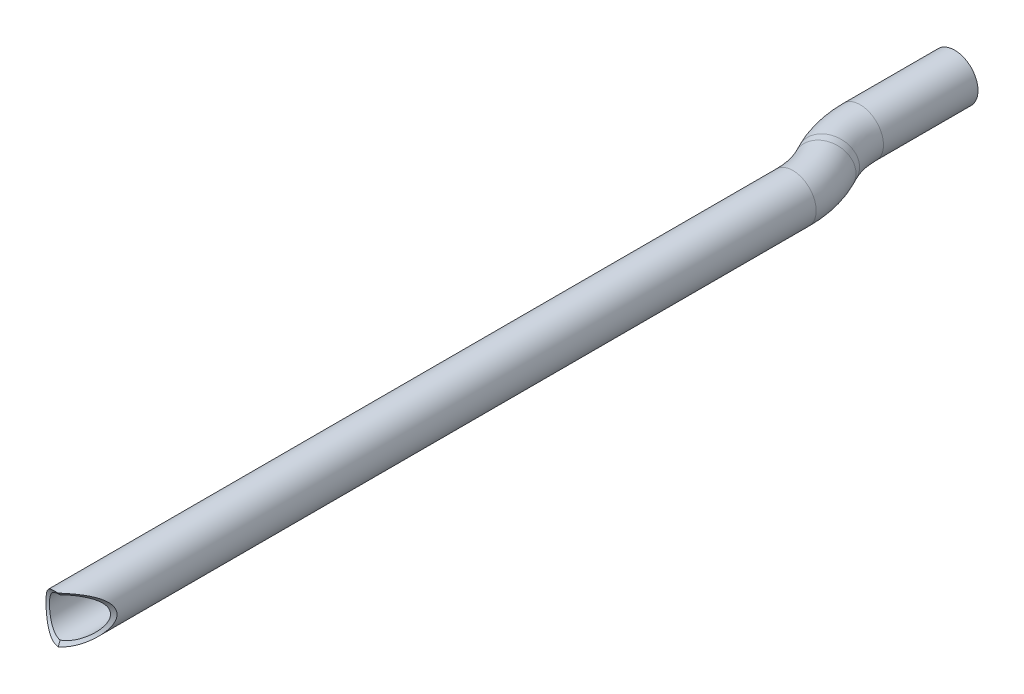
ISO-10303-21;
HEADER;
FILE_DESCRIPTION(('STEP AP214'),'2;1');
FILE_NAME('part.step','',(''),(''),'','','');
FILE_SCHEMA(('AUTOMOTIVE_DESIGN { 1 0 10303 214 1 1 1 1 }'));
ENDSEC;
DATA;
#1=APPLICATION_CONTEXT('core data for automotive mechanical design processes');
#2=APPLICATION_PROTOCOL_DEFINITION('international standard','automotive_design',2000,#1);
#3=PRODUCT_CONTEXT('',#1,'mechanical');
#4=PRODUCT('Part','Part','',(#3));
#5=PRODUCT_RELATED_PRODUCT_CATEGORY('part','',(#4));
#6=PRODUCT_DEFINITION_FORMATION('','',#4);
#7=PRODUCT_DEFINITION_CONTEXT('part definition',#1,'design');
#8=PRODUCT_DEFINITION('design','',#6,#7);
#9=PRODUCT_DEFINITION_SHAPE('','',#8);
#10=(LENGTH_UNIT() NAMED_UNIT(*) SI_UNIT(.MILLI.,.METRE.));
#11=(NAMED_UNIT(*) PLANE_ANGLE_UNIT() SI_UNIT($,.RADIAN.));
#12=(NAMED_UNIT(*) SI_UNIT($,.STERADIAN.) SOLID_ANGLE_UNIT());
#13=UNCERTAINTY_MEASURE_WITH_UNIT(LENGTH_MEASURE(1.E-05),#10,'distance_accuracy_value','');
#14=(GEOMETRIC_REPRESENTATION_CONTEXT(3) GLOBAL_UNCERTAINTY_ASSIGNED_CONTEXT((#13)) GLOBAL_UNIT_ASSIGNED_CONTEXT((#10,
#11,#12)) REPRESENTATION_CONTEXT('',''));
#15=CARTESIAN_POINT('',(0.,0.,0.));
#16=DIRECTION('',(0.,0.,1.));
#17=DIRECTION('',(1.,0.,0.));
#18=AXIS2_PLACEMENT_3D('',#15,#16,#17);
#19=CARTESIAN_POINT('',(231.,0.,-870.557280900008));
#20=DIRECTION('',(0.,0.,1.));
#21=DIRECTION('',(1.,0.,0.));
#22=AXIS2_PLACEMENT_3D('',#19,#20,#21);
#23=CYLINDRICAL_SURFACE('',#22,10.);
#24=CARTESIAN_POINT('',(231.,0.,-870.557280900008));
#25=DIRECTION('',(0.,0.,1.));
#26=DIRECTION('',(1.,0.,0.));
#27=AXIS2_PLACEMENT_3D('',#24,#25,#26);
#28=CIRCLE('',#27,10.);
#29=CARTESIAN_POINT('',(241.,0.,-870.557280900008));
#30=VERTEX_POINT('',#29);
#31=EDGE_CURVE('E61',#30,#30,#28,.T.);
#32=ORIENTED_EDGE('',*,*,#31,.T.);
#33=EDGE_LOOP('',(#32));
#34=FACE_BOUND('',#33,.T.);
#35=CARTESIAN_POINT('',(221.,0.,-553.243589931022));
#36=CARTESIAN_POINT('',(220.999998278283,0.280793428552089,-553.243591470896));
#37=CARTESIAN_POINT('',(221.011832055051,0.561557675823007,-553.242630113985));
#38=CARTESIAN_POINT('',(221.059083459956,1.12117569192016,-553.238911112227));
#39=CARTESIAN_POINT('',(221.094507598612,1.40002891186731,-553.236152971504));
#40=CARTESIAN_POINT('',(221.188745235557,1.95405536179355,-553.229206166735));
#41=CARTESIAN_POINT('',(221.247585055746,2.2292240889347,-553.22501589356));
#42=CARTESIAN_POINT('',(221.388226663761,2.77359633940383,-553.215835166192));
#43=CARTESIAN_POINT('',(221.470026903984,3.04280026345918,-553.21084476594));
#44=CARTESIAN_POINT('',(221.655953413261,3.57319407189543,-553.200961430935));
#45=CARTESIAN_POINT('',(221.760065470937,3.83438893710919,-553.196068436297));
#46=CARTESIAN_POINT('',(221.989919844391,4.34711239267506,-553.187550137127));
#47=CARTESIAN_POINT('',(222.115662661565,4.59864075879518,-553.183924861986));
#48=CARTESIAN_POINT('',(222.387926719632,5.09030218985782,-553.179414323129));
#49=CARTESIAN_POINT('',(222.534453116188,5.33043240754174,-553.178529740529));
#50=CARTESIAN_POINT('',(222.847201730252,5.79748762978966,-553.181294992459));
#51=CARTESIAN_POINT('',(223.013423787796,6.02441274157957,-553.184944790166));
#52=CARTESIAN_POINT('',(223.363520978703,6.46238615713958,-553.198870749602));
#53=CARTESIAN_POINT('',(223.547315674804,6.67349959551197,-553.209117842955));
#54=CARTESIAN_POINT('',(223.931627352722,7.07927846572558,-553.238618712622));
#55=CARTESIAN_POINT('',(224.132144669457,7.27394356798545,-553.25787266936));
#56=CARTESIAN_POINT('',(224.547715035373,7.64496599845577,-553.308011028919));
#57=CARTESIAN_POINT('',(224.7627505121,7.82134482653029,-553.33888157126));
#58=CARTESIAN_POINT('',(225.20511843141,8.15450639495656,-553.414994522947));
#59=CARTESIAN_POINT('',(225.432449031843,8.31129205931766,-553.460234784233));
#60=CARTESIAN_POINT('',(225.876012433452,8.59112136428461,-553.562920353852));
#61=CARTESIAN_POINT('',(226.091467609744,8.71591882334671,-553.618945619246));
#62=CARTESIAN_POINT('',(226.52740160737,8.94744397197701,-553.746617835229));
#63=CARTESIAN_POINT('',(226.747879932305,9.05417343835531,-553.818263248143));
#64=CARTESIAN_POINT('',(227.190777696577,9.24923496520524,-553.978024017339));
#65=CARTESIAN_POINT('',(227.413195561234,9.33758072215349,-554.066127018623));
#66=CARTESIAN_POINT('',(227.857241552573,9.49624478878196,-554.258942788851));
#67=CARTESIAN_POINT('',(228.078869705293,9.56656369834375,-554.363655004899));
#68=CARTESIAN_POINT('',(228.493009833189,9.68275353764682,-554.575769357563));
#69=CARTESIAN_POINT('',(228.685893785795,9.73052254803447,-554.681422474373));
#70=CARTESIAN_POINT('',(229.067657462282,9.81347072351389,-554.904189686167));
#71=CARTESIAN_POINT('',(229.256537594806,9.84865117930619,-555.021302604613));
#72=CARTESIAN_POINT('',(229.629386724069,9.90742466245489,-555.265876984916));
#73=CARTESIAN_POINT('',(229.81335414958,9.93101402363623,-555.393341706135));
#74=CARTESIAN_POINT('',(230.175746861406,9.96763631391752,-555.657322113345));
#75=CARTESIAN_POINT('',(230.354171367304,9.98066776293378,-555.793839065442));
#76=CARTESIAN_POINT('',(230.834782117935,10.0033034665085,-556.178319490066));
#77=CARTESIAN_POINT('',(231.131136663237,10.0032825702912,-556.434183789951));
#78=CARTESIAN_POINT('',(231.706682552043,9.97916120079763,-556.963504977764));
#79=CARTESIAN_POINT('',(231.985861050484,9.9550429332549,-557.236974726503));
#80=CARTESIAN_POINT('',(232.529666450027,9.88612947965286,-557.797876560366));
#81=CARTESIAN_POINT('',(232.794220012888,9.84123910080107,-558.085367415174));
#82=CARTESIAN_POINT('',(233.309277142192,9.73326756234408,-558.669478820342));
#83=CARTESIAN_POINT('',(233.55977503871,9.67017912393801,-558.966102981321));
#84=CARTESIAN_POINT('',(234.021474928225,9.5353003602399,-559.532521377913));
#85=CARTESIAN_POINT('',(234.233969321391,9.46522936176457,-559.80167988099));
#86=CARTESIAN_POINT('',(234.650130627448,9.31266103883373,-560.343182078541));
#87=CARTESIAN_POINT('',(234.853799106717,9.23016593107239,-560.615525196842));
#88=CARTESIAN_POINT('',(235.253426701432,9.05296535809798,-561.162355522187));
#89=CARTESIAN_POINT('',(235.449377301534,8.95824687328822,-561.43684471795));
#90=CARTESIAN_POINT('',(235.834018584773,8.7566779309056,-561.986463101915));
#91=CARTESIAN_POINT('',(236.022709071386,8.64982714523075,-562.261592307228));
#92=CARTESIAN_POINT('',(236.392632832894,8.4241487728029,-562.810328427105));
#93=CARTESIAN_POINT('',(236.573890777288,8.30536625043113,-563.083937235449));
#94=CARTESIAN_POINT('',(236.929975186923,8.05498423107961,-563.629506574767));
#95=CARTESIAN_POINT('',(237.104801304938,7.92338404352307,-563.901467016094));
#96=CARTESIAN_POINT('',(237.447913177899,7.64675915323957,-564.44218329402));
#97=CARTESIAN_POINT('',(237.616206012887,7.50174959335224,-564.71094236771));
#98=CARTESIAN_POINT('',(237.946306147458,7.19717090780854,-565.244103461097));
#99=CARTESIAN_POINT('',(238.108114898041,7.03760506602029,-565.508506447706));
#100=CARTESIAN_POINT('',(238.383906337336,6.7458957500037,-565.963639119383));
#101=CARTESIAN_POINT('',(238.499432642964,6.61733689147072,-566.155733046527));
#102=CARTESIAN_POINT('',(238.726449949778,6.35079710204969,-566.535731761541));
#103=CARTESIAN_POINT('',(238.837941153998,6.21281664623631,-566.723636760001));
#104=CARTESIAN_POINT('',(239.056621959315,5.92649402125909,-567.094415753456));
#105=CARTESIAN_POINT('',(239.163806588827,5.77814038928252,-567.277283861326));
#106=CARTESIAN_POINT('',(239.373187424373,5.47031857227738,-567.636442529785));
#107=CARTESIAN_POINT('',(239.475383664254,5.31085046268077,-567.812733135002));
#108=CARTESIAN_POINT('',(239.675141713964,4.97795335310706,-568.158982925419));
#109=CARTESIAN_POINT('',(239.772638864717,4.8043880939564,-568.328849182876));
#110=CARTESIAN_POINT('',(239.960714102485,4.4437572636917,-568.657934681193));
#111=CARTESIAN_POINT('',(240.051290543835,4.25668850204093,-568.817151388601));
#112=CARTESIAN_POINT('',(240.223828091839,3.86858314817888,-569.121567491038));
#113=CARTESIAN_POINT('',(240.305812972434,3.66758780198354,-569.26680547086));
#114=CARTESIAN_POINT('',(240.459558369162,3.25056501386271,-569.540015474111));
#115=CARTESIAN_POINT('',(240.531322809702,3.03454338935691,-569.667994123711));
#116=CARTESIAN_POINT('',(240.673548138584,2.54886440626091,-569.92225431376));
#117=CARTESIAN_POINT('',(240.741701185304,2.27634147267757,-570.04452722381));
#118=CARTESIAN_POINT('',(240.827696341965,1.85393855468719,-570.199105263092));
#119=CARTESIAN_POINT('',(240.853655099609,1.71087252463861,-570.245825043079));
#120=CARTESIAN_POINT('',(240.899640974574,1.42078745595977,-570.328654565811));
#121=CARTESIAN_POINT('',(240.919670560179,1.27377009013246,-570.364768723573));
#122=CARTESIAN_POINT('',(240.953471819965,0.975277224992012,-570.425746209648));
#123=CARTESIAN_POINT('',(240.967184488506,0.823773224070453,-570.450503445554));
#124=CARTESIAN_POINT('',(240.987703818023,0.518773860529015,-570.487559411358));
#125=CARTESIAN_POINT('',(240.994510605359,0.365278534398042,-570.499858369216));
#126=CARTESIAN_POINT('',(241.001016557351,0.057679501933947,-570.511613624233));
#127=CARTESIAN_POINT('',(241.00071739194,-0.09642405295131,-570.511072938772));
#128=CARTESIAN_POINT('',(240.993024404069,-0.403864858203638,-570.497173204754));
#129=CARTESIAN_POINT('',(240.985630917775,-0.557202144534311,-570.483814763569));
#130=CARTESIAN_POINT('',(240.965087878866,-0.846032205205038,-570.446718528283));
#131=CARTESIAN_POINT('',(240.952611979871,-0.981731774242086,-570.424195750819));
#132=CARTESIAN_POINT('',(240.922409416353,-1.25064913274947,-570.369708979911));
#133=CARTESIAN_POINT('',(240.904681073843,-1.38386611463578,-570.337741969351));
#134=CARTESIAN_POINT('',(240.844135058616,-1.77870632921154,-570.228663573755));
#135=CARTESIAN_POINT('',(240.793948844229,-2.03561945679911,-570.138361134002));
#136=CARTESIAN_POINT('',(240.648185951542,-2.65689146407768,-569.876795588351));
#137=CARTESIAN_POINT('',(240.542444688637,-3.01125615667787,-569.687596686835));
#138=CARTESIAN_POINT('',(240.364032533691,-3.5137912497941,-569.370181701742));
#139=CARTESIAN_POINT('',(240.301140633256,-3.67671422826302,-569.258560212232));
#140=CARTESIAN_POINT('',(240.169666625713,-3.99331049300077,-569.025922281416));
#141=CARTESIAN_POINT('',(240.101085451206,-4.14698528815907,-568.904907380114));
#142=CARTESIAN_POINT('',(239.908473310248,-4.55185216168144,-568.566175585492));
#143=CARTESIAN_POINT('',(239.779740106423,-4.79453984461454,-568.340974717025));
#144=CARTESIAN_POINT('',(239.511023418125,-5.25680319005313,-567.874108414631));
#145=CARTESIAN_POINT('',(239.371031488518,-5.47636121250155,-567.632430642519));
#146=CARTESIAN_POINT('',(239.081481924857,-5.89530544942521,-567.136490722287));
#147=CARTESIAN_POINT('',(238.931901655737,-6.09464083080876,-566.882199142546));
#148=CARTESIAN_POINT('',(238.624729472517,-6.47481532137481,-566.364698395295));
#149=CARTESIAN_POINT('',(238.467134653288,-6.6556476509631,-566.101486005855));
#150=CARTESIAN_POINT('',(238.155827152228,-6.98873776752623,-565.586886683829));
#151=CARTESIAN_POINT('',(238.002589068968,-7.14210462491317,-565.335926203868));
#152=CARTESIAN_POINT('',(237.690263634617,-7.43547352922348,-564.829956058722));
#153=CARTESIAN_POINT('',(237.531177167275,-7.57547758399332,-564.574947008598));
#154=CARTESIAN_POINT('',(237.207108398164,-7.84321499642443,-564.061836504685));
#155=CARTESIAN_POINT('',(237.042120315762,-7.97093584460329,-563.803732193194));
#156=CARTESIAN_POINT('',(236.706349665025,-8.21465815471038,-563.285764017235));
#157=CARTESIAN_POINT('',(236.535566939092,-8.33065929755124,-563.025900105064));
#158=CARTESIAN_POINT('',(236.18806834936,-8.55139170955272,-562.505516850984));
#159=CARTESIAN_POINT('',(236.011354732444,-8.65612718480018,-562.244997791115));
#160=CARTESIAN_POINT('',(235.651567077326,-8.85466783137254,-561.724174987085));
#161=CARTESIAN_POINT('',(235.468492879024,-8.94847272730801,-561.463871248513));
#162=CARTESIAN_POINT('',(235.095615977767,-9.12515556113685,-560.944694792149));
#163=CARTESIAN_POINT('',(234.905818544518,-9.20804182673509,-560.685821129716));
#164=CARTESIAN_POINT('',(234.518717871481,-9.36280250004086,-560.170443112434));
#165=CARTESIAN_POINT('',(234.321415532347,-9.43467822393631,-559.913938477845));
#166=CARTESIAN_POINT('',(233.906438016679,-9.57095258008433,-559.389341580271));
#167=CARTESIAN_POINT('',(233.688249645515,-9.63464936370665,-559.12147090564));
#168=CARTESIAN_POINT('',(233.241337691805,-9.74831141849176,-558.591609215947));
#169=CARTESIAN_POINT('',(233.012613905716,-9.79827642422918,-558.329618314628));
#170=CARTESIAN_POINT('',(232.543685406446,-9.88300237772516,-557.814176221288));
#171=CARTESIAN_POINT('',(232.303497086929,-9.91778435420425,-557.560713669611));
#172=CARTESIAN_POINT('',(231.810110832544,-9.97021860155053,-557.064876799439));
#173=CARTESIAN_POINT('',(231.556915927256,-9.9878748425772,-556.822499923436));
#174=CARTESIAN_POINT('',(231.094892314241,-10.0015866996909,-556.405155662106));
#175=CARTESIAN_POINT('',(230.888837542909,-10.0015964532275,-556.227254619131));
#176=CARTESIAN_POINT('',(230.468176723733,-9.98806510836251,-555.882323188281));
#177=CARTESIAN_POINT('',(230.253570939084,-9.97452442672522,-555.715292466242));
#178=CARTESIAN_POINT('',(229.816535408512,-9.93214557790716,-555.394597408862));
#179=CARTESIAN_POINT('',(229.594119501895,-9.90333330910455,-555.240910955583));
#180=CARTESIAN_POINT('',(229.142196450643,-9.82857907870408,-554.948856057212));
#181=CARTESIAN_POINT('',(228.912690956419,-9.78264107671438,-554.810484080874));
#182=CARTESIAN_POINT('',(228.486776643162,-9.68108539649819,-554.572398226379));
#183=CARTESIAN_POINT('',(228.291148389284,-9.62831158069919,-554.470071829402));
#184=CARTESIAN_POINT('',(227.897841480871,-9.50888155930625,-554.278253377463));
#185=CARTESIAN_POINT('',(227.700163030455,-9.44222672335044,-554.188760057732));
#186=CARTESIAN_POINT('',(227.304637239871,-9.2945601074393,-554.022968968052));
#187=CARTESIAN_POINT('',(227.106789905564,-9.21354880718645,-553.946670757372));
#188=CARTESIAN_POINT('',(226.712968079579,-9.03703037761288,-553.807104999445));
#189=CARTESIAN_POINT('',(226.516993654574,-8.94152273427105,-553.743837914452));
#190=CARTESIAN_POINT('',(226.129300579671,-8.73637840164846,-553.629775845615));
#191=CARTESIAN_POINT('',(225.93757547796,-8.62676513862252,-553.578960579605));
#192=CARTESIAN_POINT('',(225.559948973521,-8.39375210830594,-553.488614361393));
#193=CARTESIAN_POINT('',(225.374047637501,-8.27035218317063,-553.449083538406));
#194=CARTESIAN_POINT('',(225.009619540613,-8.01033612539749,-553.379969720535));
#195=CARTESIAN_POINT('',(224.831097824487,-7.87371115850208,-553.350393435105));
#196=CARTESIAN_POINT('',(224.482975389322,-7.58808891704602,-553.299784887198));
#197=CARTESIAN_POINT('',(224.313375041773,-7.4390911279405,-553.278752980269));
#198=CARTESIAN_POINT('',(223.975368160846,-7.12118312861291,-553.242836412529));
#199=CARTESIAN_POINT('',(223.807523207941,-6.95163162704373,-553.228346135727));
#200=CARTESIAN_POINT('',(223.484204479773,-6.60073811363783,-553.205629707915));
#201=CARTESIAN_POINT('',(223.328731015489,-6.41939580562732,-553.197403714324));
#202=CARTESIAN_POINT('',(223.031038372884,-6.04588343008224,-553.18573383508));
#203=CARTESIAN_POINT('',(222.888824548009,-5.85370903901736,-553.182291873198));
#204=CARTESIAN_POINT('',(222.618509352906,-5.45964435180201,-553.178881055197));
#205=CARTESIAN_POINT('',(222.490408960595,-5.25775338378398,-553.178912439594));
#206=CARTESIAN_POINT('',(222.233367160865,-4.81860719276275,-553.181457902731));
#207=CARTESIAN_POINT('',(222.106464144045,-4.58015755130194,-553.184292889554));
#208=CARTESIAN_POINT('',(221.872355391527,-4.09377204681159,-553.191541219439));
#209=CARTESIAN_POINT('',(221.765152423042,-3.84583485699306,-553.195954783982));
#210=CARTESIAN_POINT('',(221.571234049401,-3.34231721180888,-553.205227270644));
#211=CARTESIAN_POINT('',(221.484501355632,-3.08674341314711,-553.210085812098));
#212=CARTESIAN_POINT('',(221.331992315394,-2.56949959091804,-553.219368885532));
#213=CARTESIAN_POINT('',(221.266210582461,-2.30783115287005,-553.223793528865));
#214=CARTESIAN_POINT('',(221.140998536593,-1.70812547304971,-553.232607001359));
#215=CARTESIAN_POINT('',(221.088168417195,-1.36868429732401,-553.236658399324));
#216=CARTESIAN_POINT('',(221.017669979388,-0.686147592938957,-553.242148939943));
#217=CARTESIAN_POINT('',(221.000002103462,-0.343052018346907,-553.243588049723));
#218=CARTESIAN_POINT('',(221.,0.,-553.243589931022));
#219=B_SPLINE_CURVE_WITH_KNOTS('',3,(#35,#36,#37,#38,#39,#40,#41,#42,#43,#44,#45,#46,#47,#48,
#49,#50,#51,#52,#53,#54,#55,#56,#57,#58,#59,#60,#61,#62,#63,#64,#65,#66,#67,#68,#69,#70,#71,#72,
#73,#74,#75,#76,#77,#78,#79,#80,#81,#82,#83,#84,#85,#86,#87,#88,#89,#90,#91,#92,#93,#94,#95,#96,
#97,#98,#99,#100,#101,#102,#103,#104,#105,#106,#107,#108,#109,#110,#111,#112,#113,#114,#115,
#116,#117,#118,#119,#120,#121,#122,#123,#124,#125,#126,#127,#128,#129,#130,#131,#132,#133,#134,
#135,#136,#137,#138,#139,#140,#141,#142,#143,#144,#145,#146,#147,#148,#149,#150,#151,#152,#153,
#154,#155,#156,#157,#158,#159,#160,#161,#162,#163,#164,#165,#166,#167,#168,#169,#170,#171,#172,
#173,#174,#175,#176,#177,#178,#179,#180,#181,#182,#183,#184,#185,#186,#187,#188,#189,#190,#191,
#192,#193,#194,#195,#196,#197,#198,#199,#200,#201,#202,#203,#204,#205,#206,#207,#208,#209,#210,
#211,#212,#213,#214,#215,#216,#217,#218),.UNSPECIFIED.,.T.,.F.,(4,2,2,2,2,2,2,2,2,2,2,2,2,2,2,2,
2,2,2,2,2,2,2,2,2,2,2,2,2,2,2,2,2,2,2,2,2,2,2,2,2,2,2,2,2,2,2,2,2,2,2,2,2,2,2,2,2,2,2,2,2,2,2,2,
2,2,2,2,2,2,2,2,2,2,2,2,2,2,2,2,2,2,2,2,2,2,2,2,2,2,2,4),(0.,0.842079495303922,1.6843914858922,
2.52765301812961,3.37085772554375,4.21352694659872,5.05621570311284,5.8991138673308,
6.74200518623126,7.58120782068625,8.42042726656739,9.25864854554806,10.0967445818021,
10.8612686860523,11.6257175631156,12.389594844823,13.1534467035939,13.8279027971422,
14.502289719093,15.1768898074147,15.8515844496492,17.0241555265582,18.1975931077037,
19.3764623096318,20.5558036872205,21.6054828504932,22.654974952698,23.7055942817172,
24.7562420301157,25.8030610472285,26.8499364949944,27.8956438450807,28.9411158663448,
29.7161294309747,30.4911039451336,31.2669488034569,32.0427883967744,32.8273099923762,
33.612017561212,34.3944929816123,35.1766671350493,36.092183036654,36.5499123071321,
37.0074507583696,37.4691804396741,37.9309016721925,38.3925143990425,38.8541052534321,
39.2680038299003,39.6820347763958,40.5097946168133,41.748586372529,42.3700522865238,
42.9914165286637,44.0553569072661,45.1201029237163,46.1874622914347,47.2552113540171,
48.2497562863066,49.2441515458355,50.2395490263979,51.2349736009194,52.230025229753,
53.2251019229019,54.2194152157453,55.2136095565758,56.2671136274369,57.3206380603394,
58.3726986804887,59.4245153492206,60.2406085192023,61.0566765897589,61.8713651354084,
62.6858654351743,63.3661026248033,64.0462727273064,64.726420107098,65.4065916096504,
66.0856477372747,66.7647116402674,67.444232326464,68.1237812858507,68.8401149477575,
69.5564666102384,70.2731062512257,70.9897955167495,71.7992744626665,72.6088670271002,
73.4177733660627,74.2264715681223,75.2552471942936,76.284035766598),.UNSPECIFIED.);
#220=CARTESIAN_POINT('',(230.381835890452,9.98087536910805,-555.81743993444));
#221=VERTEX_POINT('',#220);
#222=CARTESIAN_POINT('',(230.381835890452,-9.98087536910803,-555.81743993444));
#223=VERTEX_POINT('',#222);
#224=EDGE_CURVE('E64',#221,#223,#219,.T.);
#225=ORIENTED_EDGE('',*,*,#224,.T.);
#226=CARTESIAN_POINT('',(241.,0.,-560.));
#227=CARTESIAN_POINT('',(241.000000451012,-0.247464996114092,-560.000000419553));
#228=CARTESIAN_POINT('',(240.990801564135,-0.494924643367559,-559.993425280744));
#229=CARTESIAN_POINT('',(240.954161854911,-0.987787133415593,-559.967289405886));
#230=CARTESIAN_POINT('',(240.926721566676,-1.23319003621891,-559.947729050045));
#231=CARTESIAN_POINT('',(240.854031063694,-1.72008364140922,-559.896088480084));
#232=CARTESIAN_POINT('',(240.808774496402,-1.96157291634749,-559.864003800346));
#233=CARTESIAN_POINT('',(240.701138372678,-2.43880204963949,-559.788061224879));
#234=CARTESIAN_POINT('',(240.63875845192,-2.67454178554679,-559.744203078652));
#235=CARTESIAN_POINT('',(240.498112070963,-3.13753083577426,-559.645937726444));
#236=CARTESIAN_POINT('',(240.41993165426,-3.36481856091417,-559.591587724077));
#237=CARTESIAN_POINT('',(240.24839236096,-3.81109103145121,-559.473266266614));
#238=CARTESIAN_POINT('',(240.155027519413,-4.0300724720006,-559.409291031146));
#239=CARTESIAN_POINT('',(239.954151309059,-4.45860482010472,-559.272956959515));
#240=CARTESIAN_POINT('',(239.846645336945,-4.66815928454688,-559.200601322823));
#241=CARTESIAN_POINT('',(239.618360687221,-5.07727885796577,-559.048711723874));
#242=CARTESIAN_POINT('',(239.497577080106,-5.27684021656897,-558.969175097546));
#243=CARTESIAN_POINT('',(239.232282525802,-5.6827322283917,-558.796851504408));
#244=CARTESIAN_POINT('',(239.086615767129,-5.88807399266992,-558.703515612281));
#245=CARTESIAN_POINT('',(238.781573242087,-6.28569196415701,-558.51154779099));
#246=CARTESIAN_POINT('',(238.622195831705,-6.47796659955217,-558.412915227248));
#247=CARTESIAN_POINT('',(238.290309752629,-6.84934285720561,-558.211926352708));
#248=CARTESIAN_POINT('',(238.117781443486,-7.02842395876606,-558.109564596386));
#249=CARTESIAN_POINT('',(237.760518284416,-7.3727147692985,-557.90308214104));
#250=CARTESIAN_POINT('',(237.575787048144,-7.53792855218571,-557.798961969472));
#251=CARTESIAN_POINT('',(237.159408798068,-7.88338375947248,-557.571624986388));
#252=CARTESIAN_POINT('',(236.925388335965,-8.06078638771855,-557.448423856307));
#253=CARTESIAN_POINT('',(236.44132736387,-8.39514792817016,-557.205543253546));
#254=CARTESIAN_POINT('',(236.191282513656,-8.55210126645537,-557.08586474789));
#255=CARTESIAN_POINT('',(235.675943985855,-8.84438807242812,-556.854102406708));
#256=CARTESIAN_POINT('',(235.410669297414,-8.9797477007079,-556.742009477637));
#257=CARTESIAN_POINT('',(234.865155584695,-9.22768821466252,-556.529785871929));
#258=CARTESIAN_POINT('',(234.584924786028,-9.3402814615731,-556.429648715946));
#259=CARTESIAN_POINT('',(234.102732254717,-9.50871797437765,-556.275836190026));
#260=CARTESIAN_POINT('',(233.904527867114,-9.5711752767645,-556.21756595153));
#261=CARTESIAN_POINT('',(233.502243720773,-9.68413103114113,-556.11057166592));
#262=CARTESIAN_POINT('',(233.298165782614,-9.7346331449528,-556.061844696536));
#263=CARTESIAN_POINT('',(232.885309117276,-9.82293669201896,-555.975656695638));
#264=CARTESIAN_POINT('',(232.676539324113,-9.8607603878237,-555.938175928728));
#265=CARTESIAN_POINT('',(232.255146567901,-9.92320326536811,-555.875828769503));
#266=CARTESIAN_POINT('',(232.042523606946,-9.94782245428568,-555.850962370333));
#267=CARTESIAN_POINT('',(231.613552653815,-9.98349494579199,-555.814809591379));
#268=CARTESIAN_POINT('',(231.39718933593,-9.99445760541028,-555.803613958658));
#269=CARTESIAN_POINT('',(230.963945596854,-10.0022816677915,-555.795631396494));
#270=CARTESIAN_POINT('',(230.747065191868,-9.99914350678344,-555.798844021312));
#271=CARTESIAN_POINT('',(230.314500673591,-9.97882789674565,-555.819531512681));
#272=CARTESIAN_POINT('',(230.098817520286,-9.96164046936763,-555.837016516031));
#273=CARTESIAN_POINT('',(229.670520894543,-9.91357396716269,-555.885454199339));
#274=CARTESIAN_POINT('',(229.45790777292,-9.88269334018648,-555.916408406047));
#275=CARTESIAN_POINT('',(229.01028804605,-9.80301467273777,-555.995219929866));
#276=CARTESIAN_POINT('',(228.775889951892,-9.75243183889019,-556.0447312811));
#277=CARTESIAN_POINT('',(228.314347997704,-9.63556023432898,-556.156896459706));
#278=CARTESIAN_POINT('',(228.087205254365,-9.56926905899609,-556.219552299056));
#279=CARTESIAN_POINT('',(227.417255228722,-9.34800688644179,-556.423765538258));
#280=CARTESIAN_POINT('',(226.986482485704,-9.17074973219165,-556.581460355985));
#281=CARTESIAN_POINT('',(226.304091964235,-8.83399319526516,-556.862359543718));
#282=CARTESIAN_POINT('',(226.041883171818,-8.68941642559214,-556.978728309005));
#283=CARTESIAN_POINT('',(225.53327263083,-8.37875932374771,-557.217608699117));
#284=CARTESIAN_POINT('',(225.286875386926,-8.2126729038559,-557.340122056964));
#285=CARTESIAN_POINT('',(224.810348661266,-7.85978567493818,-557.587504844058));
#286=CARTESIAN_POINT('',(224.580232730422,-7.67296793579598,-557.712376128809));
#287=CARTESIAN_POINT('',(224.137142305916,-7.27935208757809,-557.96098708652));
#288=CARTESIAN_POINT('',(223.924166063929,-7.07255602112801,-558.084726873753));
#289=CARTESIAN_POINT('',(223.514280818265,-6.63733746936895,-558.329179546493));
#290=CARTESIAN_POINT('',(223.3175532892,-6.4087198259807,-558.44984992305));
#291=CARTESIAN_POINT('',(222.943919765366,-5.93221893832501,-558.683817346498));
#292=CARTESIAN_POINT('',(222.767015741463,-5.68433378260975,-558.797113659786));
#293=CARTESIAN_POINT('',(222.435116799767,-5.17069497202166,-559.013123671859));
#294=CARTESIAN_POINT('',(222.280080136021,-4.90497683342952,-559.115857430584));
#295=CARTESIAN_POINT('',(221.993578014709,-4.3565999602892,-559.308055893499));
#296=CARTESIAN_POINT('',(221.862103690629,-4.07394765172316,-559.397525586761));
#297=CARTESIAN_POINT('',(221.6552253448,-3.56786322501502,-559.539598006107));
#298=CARTESIAN_POINT('',(221.574079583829,-3.34776380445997,-559.595778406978));
#299=CARTESIAN_POINT('',(221.426936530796,-2.90032481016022,-559.698202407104));
#300=CARTESIAN_POINT('',(221.360935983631,-2.67298680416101,-559.744448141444));
#301=CARTESIAN_POINT('',(221.244932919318,-2.21246906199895,-559.826049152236));
#302=CARTESIAN_POINT('',(221.194922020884,-1.97929245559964,-559.861410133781));
#303=CARTESIAN_POINT('',(221.111545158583,-1.5085098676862,-559.920512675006));
#304=CARTESIAN_POINT('',(221.078179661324,-1.27090376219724,-559.944253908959));
#305=CARTESIAN_POINT('',(221.028518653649,-0.792236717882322,-559.979632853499));
#306=CARTESIAN_POINT('',(221.012278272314,-0.551167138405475,-559.991231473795));
#307=CARTESIAN_POINT('',(220.997314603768,-0.0682059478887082,-560.001917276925));
#308=CARTESIAN_POINT('',(220.998591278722,0.173685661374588,-560.001004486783));
#309=CARTESIAN_POINT('',(221.018641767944,0.656389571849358,-559.986688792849));
#310=CARTESIAN_POINT('',(221.037417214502,0.897201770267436,-559.973284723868));
#311=CARTESIAN_POINT('',(221.092172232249,1.37585442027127,-559.934298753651));
#312=CARTESIAN_POINT('',(221.128151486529,1.61369492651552,-559.908717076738));
#313=CARTESIAN_POINT('',(221.214645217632,2.0733756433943,-559.847464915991));
#314=CARTESIAN_POINT('',(221.264379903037,2.29543618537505,-559.812337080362));
#315=CARTESIAN_POINT('',(221.378344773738,2.73406598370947,-559.732246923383));
#316=CARTESIAN_POINT('',(221.442579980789,2.95063330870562,-559.687281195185));
#317=CARTESIAN_POINT('',(221.584786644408,3.37701892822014,-559.588363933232));
#318=CARTESIAN_POINT('',(221.662754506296,3.58683897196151,-559.534414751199));
#319=CARTESIAN_POINT('',(221.83168334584,3.9989483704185,-559.418429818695));
#320=CARTESIAN_POINT('',(221.922649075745,4.20123493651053,-559.35639111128));
#321=CARTESIAN_POINT('',(222.125544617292,4.615399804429,-559.219299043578));
#322=CARTESIAN_POINT('',(222.238626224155,4.82649190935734,-559.143576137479));
#323=CARTESIAN_POINT('',(222.478341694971,5.23813933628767,-558.985013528));
#324=CARTESIAN_POINT('',(222.604981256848,5.43869017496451,-558.902170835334));
#325=CARTESIAN_POINT('',(222.870936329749,5.82872747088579,-558.730724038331));
#326=CARTESIAN_POINT('',(223.010256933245,6.01820943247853,-558.642117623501));
#327=CARTESIAN_POINT('',(223.300761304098,6.38565493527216,-558.460554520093));
#328=CARTESIAN_POINT('',(223.451946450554,6.56361713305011,-558.367597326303));
#329=CARTESIAN_POINT('',(223.793914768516,6.93887026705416,-558.161652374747));
#330=CARTESIAN_POINT('',(223.986912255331,7.1338296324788,-558.0480844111));
#331=CARTESIAN_POINT('',(224.387723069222,7.50684786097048,-557.819269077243));
#332=CARTESIAN_POINT('',(224.595538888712,7.68490386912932,-557.704021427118));
#333=CARTESIAN_POINT('',(225.02549342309,8.02372939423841,-557.474391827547));
#334=CARTESIAN_POINT('',(225.247640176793,8.18448907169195,-557.360010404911));
#335=CARTESIAN_POINT('',(225.70571869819,8.48799484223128,-557.135061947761));
#336=CARTESIAN_POINT('',(225.941648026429,8.63074410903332,-557.024494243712));
#337=CARTESIAN_POINT('',(226.389317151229,8.87672895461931,-556.827029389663));
#338=CARTESIAN_POINT('',(226.599131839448,8.98265899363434,-556.739121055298));
#339=CARTESIAN_POINT('',(227.028153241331,9.18042568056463,-556.570556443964));
#340=CARTESIAN_POINT('',(227.247359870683,9.27226245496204,-556.489900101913));
#341=CARTESIAN_POINT('',(227.694350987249,9.44084938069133,-556.338432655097));
#342=CARTESIAN_POINT('',(227.922119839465,9.51762557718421,-556.267604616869));
#343=CARTESIAN_POINT('',(228.385825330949,9.65528530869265,-556.138264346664));
#344=CARTESIAN_POINT('',(228.621759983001,9.71617268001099,-556.079749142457));
#345=CARTESIAN_POINT('',(229.055950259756,9.8112410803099,-555.987146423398));
#346=CARTESIAN_POINT('',(229.253043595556,9.84828369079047,-555.950539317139));
#347=CARTESIAN_POINT('',(229.650799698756,9.91060832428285,-555.888467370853));
#348=CARTESIAN_POINT('',(229.85146168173,9.93589289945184,-555.863000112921));
#349=CARTESIAN_POINT('',(230.254942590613,9.97426268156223,-555.824196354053));
#350=CARTESIAN_POINT('',(230.457759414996,9.98735883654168,-555.810848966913));
#351=CARTESIAN_POINT('',(230.864261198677,10.0011464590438,-555.796793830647));
#352=CARTESIAN_POINT('',(231.067946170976,10.0018377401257,-555.796086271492));
#353=CARTESIAN_POINT('',(231.474628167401,9.99080123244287,-555.807341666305));
#354=CARTESIAN_POINT('',(231.677625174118,9.97907313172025,-555.819304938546));
#355=CARTESIAN_POINT('',(232.081435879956,9.94341928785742,-555.85540715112));
#356=CARTESIAN_POINT('',(232.282249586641,9.91949358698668,-555.879546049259));
#357=CARTESIAN_POINT('',(232.680629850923,9.8598225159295,-555.939098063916));
#358=CARTESIAN_POINT('',(232.878192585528,9.82406414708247,-555.974523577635));
#359=CARTESIAN_POINT('',(233.268927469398,9.74124687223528,-556.055419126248));
#360=CARTESIAN_POINT('',(233.462097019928,9.69418145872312,-556.100894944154));
#361=CARTESIAN_POINT('',(233.907738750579,9.57157397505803,-556.217354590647));
#362=CARTESIAN_POINT('',(234.158154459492,9.49178525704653,-556.291762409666));
#363=CARTESIAN_POINT('',(234.648558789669,9.31429500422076,-556.452666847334));
#364=CARTESIAN_POINT('',(234.888542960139,9.21658591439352,-556.539168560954));
#365=CARTESIAN_POINT('',(235.357724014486,9.00425602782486,-556.721144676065));
#366=CARTESIAN_POINT('',(235.58690721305,8.88961449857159,-556.816630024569));
#367=CARTESIAN_POINT('',(236.033823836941,8.64439628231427,-557.013589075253));
#368=CARTESIAN_POINT('',(236.251558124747,8.51382079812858,-557.115062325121));
#369=CARTESIAN_POINT('',(236.681049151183,8.23366093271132,-557.324230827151));
#370=CARTESIAN_POINT('',(236.892488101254,8.08366007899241,-557.432019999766));
#371=CARTESIAN_POINT('',(237.302727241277,7.76805032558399,-557.648778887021));
#372=CARTESIAN_POINT('',(237.501527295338,7.60244125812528,-557.75774861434));
#373=CARTESIAN_POINT('',(237.886081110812,7.25595506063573,-557.974677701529));
#374=CARTESIAN_POINT('',(238.071830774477,7.07507317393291,-558.082636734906));
#375=CARTESIAN_POINT('',(238.429567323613,6.69843230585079,-558.295438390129));
#376=CARTESIAN_POINT('',(238.601552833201,6.50267184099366,-558.400280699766));
#377=CARTESIAN_POINT('',(238.959163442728,6.06180651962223,-558.62241693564));
#378=CARTESIAN_POINT('',(239.142066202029,5.81399805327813,-558.738761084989));
#379=CARTESIAN_POINT('',(239.486060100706,5.29930099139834,-558.961328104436));
#380=CARTESIAN_POINT('',(239.647147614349,5.03240923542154,-559.067549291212));
#381=CARTESIAN_POINT('',(239.945205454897,4.48121855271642,-559.266665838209));
#382=CARTESIAN_POINT('',(240.082207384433,4.19694310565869,-559.359578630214));
#383=CARTESIAN_POINT('',(240.330032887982,3.61262847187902,-559.529277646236));
#384=CARTESIAN_POINT('',(240.44086661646,3.31259545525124,-559.606070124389));
#385=CARTESIAN_POINT('',(240.612953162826,2.76662161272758,-559.726105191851));
#386=CARTESIAN_POINT('',(240.679748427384,2.52321883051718,-559.77301216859));
#387=CARTESIAN_POINT('',(240.795041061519,2.03008484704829,-559.854282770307));
#388=CARTESIAN_POINT('',(240.843542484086,1.78035506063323,-559.888649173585));
#389=CARTESIAN_POINT('',(240.92144347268,1.27665821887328,-559.943969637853));
#390=CARTESIAN_POINT('',(240.950857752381,1.02269458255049,-559.964934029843));
#391=CARTESIAN_POINT('',(240.990135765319,0.512485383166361,-559.992948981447));
#392=CARTESIAN_POINT('',(240.999999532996,0.256239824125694,-559.999999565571));
#393=CARTESIAN_POINT('',(241.,0.,-560.));
#394=B_SPLINE_CURVE_WITH_KNOTS('',3,(#226,#227,#228,#229,#230,#231,#232,#233,#234,#235,#236,
#237,#238,#239,#240,#241,#242,#243,#244,#245,#246,#247,#248,#249,#250,#251,#252,#253,#254,#255,
#256,#257,#258,#259,#260,#261,#262,#263,#264,#265,#266,#267,#268,#269,#270,#271,#272,#273,#274,
#275,#276,#277,#278,#279,#280,#281,#282,#283,#284,#285,#286,#287,#288,#289,#290,#291,#292,#293,
#294,#295,#296,#297,#298,#299,#300,#301,#302,#303,#304,#305,#306,#307,#308,#309,#310,#311,#312,
#313,#314,#315,#316,#317,#318,#319,#320,#321,#322,#323,#324,#325,#326,#327,#328,#329,#330,#331,
#332,#333,#334,#335,#336,#337,#338,#339,#340,#341,#342,#343,#344,#345,#346,#347,#348,#349,#350,
#351,#352,#353,#354,#355,#356,#357,#358,#359,#360,#361,#362,#363,#364,#365,#366,#367,#368,#369,
#370,#371,#372,#373,#374,#375,#376,#377,#378,#379,#380,#381,#382,#383,#384,#385,#386,#387,#388,
#389,#390,#391,#392,#393),.UNSPECIFIED.,.T.,.F.,(4,2,2,2,2,2,2,2,2,2,2,2,2,2,2,2,2,2,2,2,2,2,2,
2,2,2,2,2,2,2,2,2,2,2,2,2,2,2,2,2,2,2,2,2,2,2,2,2,2,2,2,2,2,2,2,2,2,2,2,2,2,2,2,2,2,2,2,2,2,2,2,
2,2,2,2,2,2,2,2,2,2,2,2,4),(0.,0.742130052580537,1.48423837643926,2.22661154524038,
2.96900051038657,3.70745066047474,4.44619160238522,5.18465143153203,5.9233863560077,
6.72814112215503,7.53299251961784,8.33907042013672,9.14491067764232,10.0992085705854,
11.053766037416,12.0071581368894,12.9600311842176,13.6069714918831,14.2537133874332,
14.8993136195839,15.5449135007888,16.1947760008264,16.8446183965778,17.4949227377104,
18.1453008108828,18.8787528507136,19.6123172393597,21.0811525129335,22.0439284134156,
23.0069773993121,23.9708187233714,24.9345616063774,25.9079184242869,26.881371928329,
27.8529411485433,28.8241439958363,29.5470696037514,30.2698396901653,30.9922302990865,
31.7146411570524,32.4393705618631,33.1640984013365,33.8888938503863,34.6136759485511,
35.3037005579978,35.9939645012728,36.6840480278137,37.374384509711,38.1271318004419,
38.8801966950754,39.6335653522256,40.3870217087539,41.2768512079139,42.1668307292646,
43.0573138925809,43.9476399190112,44.6998511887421,45.4520557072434,46.2029476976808,
46.9536582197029,47.5646138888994,48.1754368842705,48.7857106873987,49.3959936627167,
50.0062919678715,50.6165881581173,51.2275570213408,51.8388783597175,52.657102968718,
53.4756733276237,54.2952544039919,55.1147736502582,55.9563119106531,56.7978592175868,
57.6396695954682,58.4815640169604,59.4678999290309,60.4543995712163,61.4395950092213,
62.4244075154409,63.1936180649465,63.9626580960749,64.7311045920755,65.4995497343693),.UNSPECIFIED.);
#395=EDGE_CURVE('E51',#223,#221,#394,.T.);
#396=ORIENTED_EDGE('',*,*,#395,.T.);
#397=EDGE_LOOP('',(#225,#396));
#398=FACE_BOUND('',#397,.T.);
#399=ADVANCED_FACE('F32',(#34,#398),#23,.T.);
#400=CARTESIAN_POINT('',(231.,0.,-870.557280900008));
#401=DIRECTION('',(0.,0.,1.));
#402=DIRECTION('',(1.,0.,0.));
#403=AXIS2_PLACEMENT_3D('',#400,#401,#402);
#404=CYLINDRICAL_SURFACE('',#403,8.50000000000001);
#405=CARTESIAN_POINT('',(231.,0.,-870.557280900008));
#406=DIRECTION('',(0.,0.,-1.));
#407=DIRECTION('',(-1.,0.,0.));
#408=AXIS2_PLACEMENT_3D('',#405,#406,#407);
#409=CIRCLE('',#408,8.50000000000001);
#410=CARTESIAN_POINT('',(239.5,0.,-870.557280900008));
#411=VERTEX_POINT('',#410);
#412=EDGE_CURVE('E146',#411,#411,#409,.T.);
#413=ORIENTED_EDGE('',*,*,#412,.T.);
#414=EDGE_LOOP('',(#413));
#415=FACE_BOUND('',#414,.T.);
#416=CARTESIAN_POINT('',(222.5,0.,-554.538553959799));
#417=CARTESIAN_POINT('',(222.499998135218,0.237042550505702,-554.53855556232));
#418=CARTESIAN_POINT('',(222.509919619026,0.474054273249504,-554.539152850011));
#419=CARTESIAN_POINT('',(222.549535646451,0.946489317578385,-554.541647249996));
#420=CARTESIAN_POINT('',(222.57923515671,1.18191222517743,-554.543544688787));
#421=CARTESIAN_POINT('',(222.658246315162,1.64969026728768,-554.548944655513));
#422=CARTESIAN_POINT('',(222.707579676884,1.88204171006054,-554.552448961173));
#423=CARTESIAN_POINT('',(222.825496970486,2.34175223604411,-554.561572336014));
#424=CARTESIAN_POINT('',(222.894079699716,2.56911163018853,-554.567191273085));
#425=CARTESIAN_POINT('',(223.050007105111,3.01726926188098,-554.581258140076));
#426=CARTESIAN_POINT('',(223.137355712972,3.23806611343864,-554.589706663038));
#427=CARTESIAN_POINT('',(223.330141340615,3.6714456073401,-554.610347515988));
#428=CARTESIAN_POINT('',(223.435578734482,3.88402807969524,-554.622539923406));
#429=CARTESIAN_POINT('',(223.663672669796,4.29935088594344,-554.651773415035));
#430=CARTESIAN_POINT('',(223.786325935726,4.50209308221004,-554.668813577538));
#431=CARTESIAN_POINT('',(224.047812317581,4.89622384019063,-554.709022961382));
#432=CARTESIAN_POINT('',(224.186645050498,5.08761267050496,-554.732192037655));
#433=CARTESIAN_POINT('',(224.476790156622,5.45449597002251,-554.785629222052));
#434=CARTESIAN_POINT('',(224.627860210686,5.63019980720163,-554.815774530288));
#435=CARTESIAN_POINT('',(224.942895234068,5.96781208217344,-554.884768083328));
#436=CARTESIAN_POINT('',(225.106860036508,6.12972069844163,-554.923616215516));
#437=CARTESIAN_POINT('',(225.445751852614,6.43838597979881,-555.011354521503));
#438=CARTESIAN_POINT('',(225.620670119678,6.58515449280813,-555.060236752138));
#439=CARTESIAN_POINT('',(225.979488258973,6.86264436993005,-555.169276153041));
#440=CARTESIAN_POINT('',(226.163387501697,6.99336685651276,-555.229432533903));
#441=CARTESIAN_POINT('',(226.525700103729,7.23010382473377,-555.357641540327));
#442=CARTESIAN_POINT('',(226.703697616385,7.33717010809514,-555.424930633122));
#443=CARTESIAN_POINT('',(227.063481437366,7.5363183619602,-555.570585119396));
#444=CARTESIAN_POINT('',(227.245267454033,7.62840148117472,-555.648949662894));
#445=CARTESIAN_POINT('',(227.610630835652,7.79760936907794,-555.816802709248));
#446=CARTESIAN_POINT('',(227.794208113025,7.87473486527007,-555.906290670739));
#447=CARTESIAN_POINT('',(228.161326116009,8.01439454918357,-556.096069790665));
#448=CARTESIAN_POINT('',(228.344866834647,8.07692699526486,-556.1963622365));
#449=CARTESIAN_POINT('',(228.748757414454,8.19971541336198,-556.429285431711));
#450=CARTESIAN_POINT('',(228.968732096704,8.25672788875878,-556.564281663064));
#451=CARTESIAN_POINT('',(229.404120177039,8.35181808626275,-556.847598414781));
#452=CARTESIAN_POINT('',(229.619532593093,8.38989177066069,-556.995921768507));
#453=CARTESIAN_POINT('',(230.044689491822,8.44887723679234,-557.30430820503));
#454=CARTESIAN_POINT('',(230.254424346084,8.46976143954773,-557.464389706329));
#455=CARTESIAN_POINT('',(230.667139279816,8.49599745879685,-557.794286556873));
#456=CARTESIAN_POINT('',(230.870116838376,8.50134354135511,-557.964105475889));
#457=CARTESIAN_POINT('',(231.376214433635,8.49721197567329,-558.405206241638));
#458=CARTESIAN_POINT('',(231.674508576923,8.47822014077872,-558.681955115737));
#459=CARTESIAN_POINT('',(232.254659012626,8.41196376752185,-559.248992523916));
#460=CARTESIAN_POINT('',(232.536505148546,8.36468195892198,-559.539289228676));
#461=CARTESIAN_POINT('',(233.085544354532,8.24497661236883,-560.129807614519));
#462=CARTESIAN_POINT('',(233.352696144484,8.17248605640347,-560.430053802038));
#463=CARTESIAN_POINT('',(233.872787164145,8.00448288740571,-561.036155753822));
#464=CARTESIAN_POINT('',(234.125729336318,7.90897506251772,-561.342010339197));
#465=CARTESIAN_POINT('',(234.636228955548,7.68834167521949,-561.978379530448));
#466=CARTESIAN_POINT('',(234.892829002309,7.56158960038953,-562.309097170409));
#467=CARTESIAN_POINT('',(235.392225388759,7.28286639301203,-562.970469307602));
#468=CARTESIAN_POINT('',(235.635018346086,7.13088911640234,-563.301123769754));
#469=CARTESIAN_POINT('',(236.106394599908,6.8012634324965,-563.957854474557));
#470=CARTESIAN_POINT('',(236.335022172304,6.62370145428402,-564.283942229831));
#471=CARTESIAN_POINT('',(236.778589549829,6.24049826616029,-564.928748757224));
#472=CARTESIAN_POINT('',(236.993536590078,6.03487208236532,-565.247471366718));
#473=CARTESIAN_POINT('',(237.310114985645,5.69717696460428,-565.724411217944));
#474=CARTESIAN_POINT('',(237.417166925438,5.57643795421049,-565.887102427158));
#475=CARTESIAN_POINT('',(237.626779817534,5.32564686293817,-566.208120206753));
#476=CARTESIAN_POINT('',(237.729341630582,5.195596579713,-566.36644761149));
#477=CARTESIAN_POINT('',(237.929740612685,4.92514807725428,-566.677967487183));
#478=CARTESIAN_POINT('',(238.027566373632,4.7847267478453,-566.831147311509));
#479=CARTESIAN_POINT('',(238.217571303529,4.4929913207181,-567.130531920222));
#480=CARTESIAN_POINT('',(238.309750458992,4.34167719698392,-567.276736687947));
#481=CARTESIAN_POINT('',(238.488898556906,4.02492275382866,-567.56246404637));
#482=CARTESIAN_POINT('',(238.575767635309,3.85930342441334,-567.701852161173));
#483=CARTESIAN_POINT('',(238.741500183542,3.51506479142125,-567.969089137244));
#484=CARTESIAN_POINT('',(238.820361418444,3.33644188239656,-568.096934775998));
#485=CARTESIAN_POINT('',(238.968064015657,2.96638473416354,-568.337375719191));
#486=CARTESIAN_POINT('',(239.036946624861,2.77500830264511,-568.450033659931));
#487=CARTESIAN_POINT('',(239.162934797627,2.3790039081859,-568.656773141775));
#488=CARTESIAN_POINT('',(239.220052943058,2.17439041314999,-568.75087452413));
#489=CARTESIAN_POINT('',(239.326631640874,1.72534632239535,-568.926887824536));
#490=CARTESIAN_POINT('',(239.374165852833,1.47917739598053,-569.005680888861));
#491=CARTESIAN_POINT('',(239.429312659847,1.10135194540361,-569.097229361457));
#492=CARTESIAN_POINT('',(239.445002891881,0.973974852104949,-569.123305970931));
#493=CARTESIAN_POINT('',(239.470678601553,0.717095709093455,-569.166001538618));
#494=CARTESIAN_POINT('',(239.480666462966,0.587594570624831,-569.182624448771));
#495=CARTESIAN_POINT('',(239.49472730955,0.326739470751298,-569.20603113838));
#496=CARTESIAN_POINT('',(239.49877087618,0.195379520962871,-569.212765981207));
#497=CARTESIAN_POINT('',(239.500748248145,-0.0675141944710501,-569.216059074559));
#498=CARTESIAN_POINT('',(239.498682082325,-0.199047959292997,-569.21261737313));
#499=CARTESIAN_POINT('',(239.488489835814,-0.461247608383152,-569.195647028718));
#500=CARTESIAN_POINT('',(239.480362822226,-0.59191335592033,-569.182116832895));
#501=CARTESIAN_POINT('',(239.45825836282,-0.851385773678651,-569.145344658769));
#502=CARTESIAN_POINT('',(239.44427862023,-0.980191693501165,-569.122098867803));
#503=CARTESIAN_POINT('',(239.395757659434,-1.34924335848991,-569.041501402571));
#504=CARTESIAN_POINT('',(239.354012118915,-1.5860489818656,-568.972245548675));
#505=CARTESIAN_POINT('',(239.253544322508,-2.0456268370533,-568.80611638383));
#506=CARTESIAN_POINT('',(239.194814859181,-2.26839306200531,-568.709231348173));
#507=CARTESIAN_POINT('',(239.019842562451,-2.8411155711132,-568.421796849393));
#508=CARTESIAN_POINT('',(238.891272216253,-3.17757529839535,-568.211715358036));
#509=CARTESIAN_POINT('',(238.678151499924,-3.65049306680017,-567.866786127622));
#510=CARTESIAN_POINT('',(238.603575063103,-3.80309263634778,-567.746588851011));
#511=CARTESIAN_POINT('',(238.44856685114,-4.09836443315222,-567.498020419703));
#512=CARTESIAN_POINT('',(238.368136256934,-4.24103865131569,-567.369650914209));
#513=CARTESIAN_POINT('',(238.141297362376,-4.61844532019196,-567.009638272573));
#514=CARTESIAN_POINT('',(237.989819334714,-4.84382459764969,-566.771393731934));
#515=CARTESIAN_POINT('',(237.674536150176,-5.26979933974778,-566.281219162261));
#516=CARTESIAN_POINT('',(237.510721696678,-5.47037580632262,-566.029278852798));
#517=CARTESIAN_POINT('',(237.172014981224,-5.84987997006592,-565.51526286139));
#518=CARTESIAN_POINT('',(236.997090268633,-6.02873934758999,-565.25315845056));
#519=CARTESIAN_POINT('',(236.637608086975,-6.36617066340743,-564.722737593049));
#520=CARTESIAN_POINT('',(236.453052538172,-6.52474662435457,-564.454422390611));
#521=CARTESIAN_POINT('',(236.121913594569,-6.7859157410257,-563.981434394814));
#522=CARTESIAN_POINT('',(235.977347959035,-6.89260385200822,-563.77758963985));
#523=CARTESIAN_POINT('',(235.682999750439,-7.09588005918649,-563.368600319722));
#524=CARTESIAN_POINT('',(235.533216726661,-7.19246727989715,-563.16345564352));
#525=CARTESIAN_POINT('',(235.228258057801,-7.37587372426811,-562.752560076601));
#526=CARTESIAN_POINT('',(235.073078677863,-7.46268599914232,-562.546808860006));
#527=CARTESIAN_POINT('',(234.757253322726,-7.62657842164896,-562.135636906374));
#528=CARTESIAN_POINT('',(234.596607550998,-7.70365893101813,-561.930216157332));
#529=CARTESIAN_POINT('',(234.269980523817,-7.84786730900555,-561.520989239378));
#530=CARTESIAN_POINT('',(234.104013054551,-7.91501870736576,-561.31718037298));
#531=CARTESIAN_POINT('',(233.766044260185,-8.03936711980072,-560.911504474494));
#532=CARTESIAN_POINT('',(233.594042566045,-8.09656352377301,-560.709637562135));
#533=CARTESIAN_POINT('',(233.243804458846,-8.20052935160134,-560.308962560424));
#534=CARTESIAN_POINT('',(233.065573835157,-8.24730817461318,-560.11015186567));
#535=CARTESIAN_POINT('',(232.702378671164,-8.32986088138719,-559.716483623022));
#536=CARTESIAN_POINT('',(232.517415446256,-8.36563690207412,-559.521625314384));
#537=CARTESIAN_POINT('',(232.1347168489,-8.42621311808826,-559.131269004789));
#538=CARTESIAN_POINT('',(231.936764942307,-8.45065310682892,-558.935926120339));
#539=CARTESIAN_POINT('',(231.533011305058,-8.48569117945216,-558.552203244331));
#540=CARTESIAN_POINT('',(231.327210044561,-8.49629009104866,-558.363822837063));
#541=CARTESIAN_POINT('',(230.908017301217,-8.50208242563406,-557.996084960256));
#542=CARTESIAN_POINT('',(230.694638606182,-8.49730068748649,-557.816713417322));
#543=CARTESIAN_POINT('',(230.260313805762,-8.47054760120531,-557.468685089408));
#544=CARTESIAN_POINT('',(230.039368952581,-8.44857908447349,-557.300026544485));
#545=CARTESIAN_POINT('',(229.627813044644,-8.39064172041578,-557.002311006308));
#546=CARTESIAN_POINT('',(229.438203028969,-8.35757647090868,-556.871308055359));
#547=CARTESIAN_POINT('',(229.055317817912,-8.27686382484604,-556.619511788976));
#548=CARTESIAN_POINT('',(228.862042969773,-8.22921780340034,-556.498717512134));
#549=CARTESIAN_POINT('',(228.473328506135,-8.11829701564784,-556.268515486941));
#550=CARTESIAN_POINT('',(228.277890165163,-8.05503102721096,-556.159101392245));
#551=CARTESIAN_POINT('',(227.886582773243,-7.91201703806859,-555.952437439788));
#552=CARTESIAN_POINT('',(227.690713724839,-7.83226913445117,-555.855187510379));
#553=CARTESIAN_POINT('',(227.299609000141,-7.65528799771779,-555.672784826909));
#554=CARTESIAN_POINT('',(227.104383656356,-7.55795563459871,-555.587705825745));
#555=CARTESIAN_POINT('',(226.718176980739,-7.34605340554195,-555.430305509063));
#556=CARTESIAN_POINT('',(226.527195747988,-7.231483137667,-555.357984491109));
#557=CARTESIAN_POINT('',(226.151913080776,-6.98544296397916,-555.225569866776));
#558=CARTESIAN_POINT('',(225.967613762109,-6.85396776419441,-555.165480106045));
#559=CARTESIAN_POINT('',(225.6081140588,-6.57490223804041,-555.056622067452));
#560=CARTESIAN_POINT('',(225.432913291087,-6.42731259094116,-555.007853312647));
#561=CARTESIAN_POINT('',(225.108987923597,-6.13104702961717,-554.92434218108));
#562=CARTESIAN_POINT('',(224.959299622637,-5.98366450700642,-554.888732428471));
#563=CARTESIAN_POINT('',(224.670550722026,-5.6773559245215,-554.824820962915));
#564=CARTESIAN_POINT('',(224.53149030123,-5.51842967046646,-554.796519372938));
#565=CARTESIAN_POINT('',(224.265137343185,-5.19002299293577,-554.746153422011));
#566=CARTESIAN_POINT('',(224.137847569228,-5.0205401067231,-554.724090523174));
#567=CARTESIAN_POINT('',(223.896042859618,-4.67212637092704,-554.685175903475));
#568=CARTESIAN_POINT('',(223.781528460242,-4.4931951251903,-554.668324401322));
#569=CARTESIAN_POINT('',(223.560024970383,-4.11668795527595,-554.638047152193));
#570=CARTESIAN_POINT('',(223.453821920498,-3.91862944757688,-554.624867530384));
#571=CARTESIAN_POINT('',(223.257358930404,-3.5145400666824,-554.602253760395));
#572=CARTESIAN_POINT('',(223.167100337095,-3.3085085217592,-554.592819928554));
#573=CARTESIAN_POINT('',(223.003232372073,-2.89001013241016,-554.576854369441));
#574=CARTESIAN_POINT('',(222.929609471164,-2.67754867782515,-554.570320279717));
#575=CARTESIAN_POINT('',(222.799430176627,-2.24747408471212,-554.559457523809));
#576=CARTESIAN_POINT('',(222.742870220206,-2.02986203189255,-554.555128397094));
#577=CARTESIAN_POINT('',(222.630277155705,-1.51330441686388,-554.546906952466));
#578=CARTESIAN_POINT('',(222.581467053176,-1.21274516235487,-554.543707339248));
#579=CARTESIAN_POINT('',(222.516329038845,-0.608107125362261,-554.539529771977));
#580=CARTESIAN_POINT('',(222.500002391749,-0.304028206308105,-554.538551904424));
#581=CARTESIAN_POINT('',(222.5,0.,-554.538553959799));
#582=B_SPLINE_CURVE_WITH_KNOTS('',3,(#416,#417,#418,#419,#420,#421,#422,#423,#424,#425,#426,
#427,#428,#429,#430,#431,#432,#433,#434,#435,#436,#437,#438,#439,#440,#441,#442,#443,#444,#445,
#446,#447,#448,#449,#450,#451,#452,#453,#454,#455,#456,#457,#458,#459,#460,#461,#462,#463,#464,
#465,#466,#467,#468,#469,#470,#471,#472,#473,#474,#475,#476,#477,#478,#479,#480,#481,#482,#483,
#484,#485,#486,#487,#488,#489,#490,#491,#492,#493,#494,#495,#496,#497,#498,#499,#500,#501,#502,
#503,#504,#505,#506,#507,#508,#509,#510,#511,#512,#513,#514,#515,#516,#517,#518,#519,#520,#521,
#522,#523,#524,#525,#526,#527,#528,#529,#530,#531,#532,#533,#534,#535,#536,#537,#538,#539,#540,
#541,#542,#543,#544,#545,#546,#547,#548,#549,#550,#551,#552,#553,#554,#555,#556,#557,#558,#559,
#560,#561,#562,#563,#564,#565,#566,#567,#568,#569,#570,#571,#572,#573,#574,#575,#576,#577,#578,
#579,#580,#581),.UNSPECIFIED.,.T.,.F.,(4,2,2,2,2,2,2,2,2,2,2,2,2,2,2,2,2,2,2,2,2,2,2,2,2,2,2,2,
2,2,2,2,2,2,2,2,2,2,2,2,2,2,2,2,2,2,2,2,2,2,2,2,2,2,2,2,2,2,2,2,2,2,2,2,2,2,2,2,2,2,2,2,2,2,2,2,
2,2,2,2,2,2,4),(0.,0.710866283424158,1.42191114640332,2.13374456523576,2.84553352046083,
3.55747175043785,4.2694247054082,4.98124238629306,5.69304322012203,6.3931574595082,
7.09326263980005,7.79281572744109,8.49231985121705,9.14652923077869,9.8006884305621,
10.4548158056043,11.1090212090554,11.9007874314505,12.6927223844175,13.4859254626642,
14.2794212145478,15.4994947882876,16.7203139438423,17.9444038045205,19.1682392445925,
20.4793570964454,21.790794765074,23.097901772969,24.4043116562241,25.0915177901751,
25.7785916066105,26.4672455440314,27.1559011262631,27.8549702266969,28.5542338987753,
29.2505192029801,29.9460559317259,30.7309439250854,31.1234272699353,31.515746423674,
31.9100007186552,32.3042531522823,32.6985662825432,33.0930342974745,33.8405578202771,
34.5883990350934,35.8316248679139,36.4555774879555,37.0794045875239,38.1614252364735,
39.2442696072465,40.3304367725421,41.4163881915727,42.2313308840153,43.0463441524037,
43.8619331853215,44.6774918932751,45.4910858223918,46.3047295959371,47.1176362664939,
47.9303849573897,48.7674376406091,49.6044402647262,50.4400918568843,51.2756058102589,
51.9734388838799,52.6712061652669,53.368582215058,54.0659541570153,54.7673876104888,
55.4688374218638,56.1705074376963,56.8721478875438,57.5106368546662,58.149136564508,
58.7877857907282,59.4264618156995,60.1010762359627,60.7757476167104,61.449868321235,
62.1238481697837,63.0355620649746,63.9473114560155),.UNSPECIFIED.);
#583=CARTESIAN_POINT('',(229.874645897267,8.42517525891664,-557.181074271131));
#584=VERTEX_POINT('',#583);
#585=CARTESIAN_POINT('',(229.874645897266,-8.42517525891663,-557.181074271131));
#586=VERTEX_POINT('',#585);
#587=EDGE_CURVE('E65',#584,#586,#582,.T.);
#588=ORIENTED_EDGE('',*,*,#587,.F.);
#589=CARTESIAN_POINT('',(239.5,0.,-560.));
#590=CARTESIAN_POINT('',(239.499998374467,0.217092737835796,-559.999998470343));
#591=CARTESIAN_POINT('',(239.491670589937,0.434228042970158,-559.994938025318));
#592=CARTESIAN_POINT('',(239.458467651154,0.866853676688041,-559.974816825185));
#593=CARTESIAN_POINT('',(239.433583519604,1.0823430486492,-559.959750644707));
#594=CARTESIAN_POINT('',(239.367547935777,1.51033548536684,-559.919955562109));
#595=CARTESIAN_POINT('',(239.32636517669,1.72283198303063,-559.895208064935));
#596=CARTESIAN_POINT('',(239.228276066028,2.14289606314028,-559.836653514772));
#597=CARTESIAN_POINT('',(239.171368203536,2.35046316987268,-559.802845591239));
#598=CARTESIAN_POINT('',(239.042850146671,2.75826704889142,-559.727153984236));
#599=CARTESIAN_POINT('',(238.971316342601,2.95853578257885,-559.685312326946));
#600=CARTESIAN_POINT('',(238.814135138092,3.35173533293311,-559.594359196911));
#601=CARTESIAN_POINT('',(238.728487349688,3.54466594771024,-559.545247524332));
#602=CARTESIAN_POINT('',(238.54391341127,3.92217910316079,-559.440790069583));
#603=CARTESIAN_POINT('',(238.44499395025,4.10676578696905,-559.385447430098));
#604=CARTESIAN_POINT('',(238.234615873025,4.46697642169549,-559.269588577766));
#605=CARTESIAN_POINT('',(238.123152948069,4.64259726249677,-559.20907058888));
#606=CARTESIAN_POINT('',(237.752968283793,5.18136949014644,-559.01178699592));
#607=CARTESIAN_POINT('',(237.472641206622,5.52726323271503,-558.867563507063));
#608=CARTESIAN_POINT('',(236.863142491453,6.17010576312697,-558.572003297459));
#609=CARTESIAN_POINT('',(236.533907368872,6.46698986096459,-558.420657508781));
#610=CARTESIAN_POINT('',(235.985209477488,6.88911607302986,-558.188941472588));
#611=CARTESIAN_POINT('',(235.780545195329,7.03272169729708,-558.106421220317));
#612=CARTESIAN_POINT('',(235.35799370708,7.30209977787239,-557.945873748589));
#613=CARTESIAN_POINT('',(235.140104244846,7.42786917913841,-557.8678473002));
#614=CARTESIAN_POINT('',(234.692346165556,7.66029574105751,-557.719167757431));
#615=CARTESIAN_POINT('',(234.462493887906,7.76697813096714,-557.648504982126));
#616=CARTESIAN_POINT('',(233.991699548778,7.96017632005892,-557.517345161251));
#617=CARTESIAN_POINT('',(233.750761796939,8.04669987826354,-557.456844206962));
#618=CARTESIAN_POINT('',(233.320011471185,8.17955249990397,-557.362210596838));
#619=CARTESIAN_POINT('',(233.132242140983,8.2305319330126,-557.325254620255));
#620=CARTESIAN_POINT('',(232.752246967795,8.31971713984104,-557.259901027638));
#621=CARTESIAN_POINT('',(232.560022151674,8.3579258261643,-557.231501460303));
#622=CARTESIAN_POINT('',(232.172443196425,8.42103818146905,-557.184260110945));
#623=CARTESIAN_POINT('',(231.977092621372,8.44595602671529,-557.165408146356));
#624=CARTESIAN_POINT('',(231.584405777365,8.48217803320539,-557.137916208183));
#625=CARTESIAN_POINT('',(231.387069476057,8.49348197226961,-557.129276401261));
#626=CARTESIAN_POINT('',(230.991482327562,8.50230276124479,-557.122539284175));
#627=CARTESIAN_POINT('',(230.793230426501,8.49978996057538,-557.124464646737));
#628=CARTESIAN_POINT('',(230.397772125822,8.48094980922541,-557.138834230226));
#629=CARTESIAN_POINT('',(230.200565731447,8.46462238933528,-557.151278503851));
#630=CARTESIAN_POINT('',(229.808530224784,8.41839573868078,-557.186216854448));
#631=CARTESIAN_POINT('',(229.613702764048,8.38848757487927,-557.2087175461));
#632=CARTESIAN_POINT('',(229.227845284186,8.31552934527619,-557.262949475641));
#633=CARTESIAN_POINT('',(229.036815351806,8.27247897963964,-557.294680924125));
#634=CARTESIAN_POINT('',(228.662620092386,8.17456191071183,-557.365743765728));
#635=CARTESIAN_POINT('',(228.479378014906,8.11989395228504,-557.404946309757));
#636=CARTESIAN_POINT('',(228.11836923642,7.99890455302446,-557.490125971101));
#637=CARTESIAN_POINT('',(227.94060442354,7.93257914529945,-557.536105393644));
#638=CARTESIAN_POINT('',(227.416585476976,7.71697912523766,-557.682397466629));
#639=CARTESIAN_POINT('',(227.079418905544,7.55103079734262,-557.791101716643));
#640=CARTESIAN_POINT('',(226.375423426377,7.14538851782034,-558.041999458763));
#641=CARTESIAN_POINT('',(226.014029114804,6.89782063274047,-558.186708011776));
#642=CARTESIAN_POINT('',(225.504390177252,6.48813380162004,-558.406785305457));
#643=CARTESIAN_POINT('',(225.339803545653,6.3450556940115,-558.48070568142));
#644=CARTESIAN_POINT('',(225.021921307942,6.04649592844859,-558.628046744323));
#645=CARTESIAN_POINT('',(224.86862765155,5.89101213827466,-558.701467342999));
#646=CARTESIAN_POINT('',(224.552394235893,5.54447386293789,-558.856903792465));
#647=CARTESIAN_POINT('',(224.39134190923,5.35154830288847,-558.938599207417));
#648=CARTESIAN_POINT('',(224.086161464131,4.95097978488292,-559.097105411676));
#649=CARTESIAN_POINT('',(223.942026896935,4.74334248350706,-559.173918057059));
#650=CARTESIAN_POINT('',(223.671883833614,4.31427505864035,-559.32060146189));
#651=CARTESIAN_POINT('',(223.545873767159,4.09284613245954,-559.390472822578));
#652=CARTESIAN_POINT('',(223.313368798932,3.637449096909,-559.521281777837));
#653=CARTESIAN_POINT('',(223.20687149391,3.40348253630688,-559.582220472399));
#654=CARTESIAN_POINT('',(223.020659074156,2.93918677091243,-559.689940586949));
#655=CARTESIAN_POINT('',(222.939709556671,2.70950081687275,-559.737357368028));
#656=CARTESIAN_POINT('',(222.797422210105,2.24217736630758,-559.821323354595));
#657=CARTESIAN_POINT('',(222.736083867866,2.00454007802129,-559.857872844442));
#658=CARTESIAN_POINT('',(222.634058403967,1.5236084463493,-559.918955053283));
#659=CARTESIAN_POINT('',(222.593349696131,1.28032029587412,-559.943500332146));
#660=CARTESIAN_POINT('',(222.533210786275,0.79019627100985,-559.979840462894));
#661=CARTESIAN_POINT('',(222.513777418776,0.543360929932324,-559.99163721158));
#662=CARTESIAN_POINT('',(222.497739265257,0.0832327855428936,-560.001371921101));
#663=CARTESIAN_POINT('',(222.498326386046,-0.129932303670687,-560.001014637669));
#664=CARTESIAN_POINT('',(222.515492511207,-0.555378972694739,-559.99059747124));
#665=CARTESIAN_POINT('',(222.532070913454,-0.767660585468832,-559.980537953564));
#666=CARTESIAN_POINT('',(222.580990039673,-1.18970745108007,-559.950962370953));
#667=CARTESIAN_POINT('',(222.613329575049,-1.39947289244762,-559.931447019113));
#668=CARTESIAN_POINT('',(222.693344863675,-1.81500711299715,-559.883425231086));
#669=CARTESIAN_POINT('',(222.741020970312,-2.02077579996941,-559.854918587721));
#670=CARTESIAN_POINT('',(222.849549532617,-2.42114489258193,-559.790503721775));
#671=CARTESIAN_POINT('',(222.90998613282,-2.61589639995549,-559.754830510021));
#672=CARTESIAN_POINT('',(223.044168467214,-2.99933693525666,-559.676340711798));
#673=CARTESIAN_POINT('',(223.117918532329,-3.18802396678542,-559.633521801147));
#674=CARTESIAN_POINT('',(223.278018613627,-3.55832485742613,-559.541591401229));
#675=CARTESIAN_POINT('',(223.364365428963,-3.73994049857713,-559.492481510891));
#676=CARTESIAN_POINT('',(223.548987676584,-4.095433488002,-559.388867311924));
#677=CARTESIAN_POINT('',(223.647267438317,-4.26930799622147,-559.334361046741));
#678=CARTESIAN_POINT('',(223.980364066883,-4.81322316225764,-559.152498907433));
#679=CARTESIAN_POINT('',(224.237051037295,-5.16727957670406,-559.016475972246));
#680=CARTESIAN_POINT('',(224.799059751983,-5.82988266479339,-558.733522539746));
#681=CARTESIAN_POINT('',(225.104437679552,-6.13837596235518,-558.586579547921));
#682=CARTESIAN_POINT('',(225.617034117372,-6.58285897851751,-558.357138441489));
#683=CARTESIAN_POINT('',(225.809637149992,-6.73578124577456,-558.27423435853));
#684=CARTESIAN_POINT('',(226.208197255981,-7.02490078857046,-558.111081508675));
#685=CARTESIAN_POINT('',(226.414156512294,-7.16109531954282,-558.030833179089));
#686=CARTESIAN_POINT('',(226.838444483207,-7.41570167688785,-557.875588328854));
#687=CARTESIAN_POINT('',(227.05676397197,-7.53412653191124,-557.800587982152));
#688=CARTESIAN_POINT('',(227.50500534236,-7.75223092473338,-557.658467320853));
#689=CARTESIAN_POINT('',(227.734923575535,-7.85191631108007,-557.591344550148));
#690=CARTESIAN_POINT('',(228.154624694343,-8.01204597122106,-557.481046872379));
#691=CARTESIAN_POINT('',(228.342415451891,-8.07631954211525,-557.435825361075));
#692=CARTESIAN_POINT('',(228.723546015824,-8.19190911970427,-557.353311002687));
#693=CARTESIAN_POINT('',(228.916882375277,-8.24323298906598,-557.316013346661));
#694=CARTESIAN_POINT('',(229.307990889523,-8.33230374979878,-557.250589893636));
#695=CARTESIAN_POINT('',(229.505758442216,-8.37006409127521,-557.222455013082));
#696=CARTESIAN_POINT('',(229.904651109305,-8.4315436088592,-557.176339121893));
#697=CARTESIAN_POINT('',(230.105776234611,-8.45526273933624,-557.158358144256));
#698=CARTESIAN_POINT('',(230.510768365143,-8.48835115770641,-557.133208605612));
#699=CARTESIAN_POINT('',(230.714643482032,-8.49765771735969,-557.126087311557));
#700=CARTESIAN_POINT('',(231.122618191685,-8.50156333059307,-557.123103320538));
#701=CARTESIAN_POINT('',(231.326717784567,-8.49616237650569,-557.127240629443));
#702=CARTESIAN_POINT('',(231.7335569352,-8.47074121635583,-557.146604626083));
#703=CARTESIAN_POINT('',(231.93629585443,-8.4507145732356,-557.161836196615));
#704=CARTESIAN_POINT('',(232.338761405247,-8.39636572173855,-557.20277615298));
#705=CARTESIAN_POINT('',(232.538488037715,-8.36204351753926,-557.228484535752));
#706=CARTESIAN_POINT('',(232.922255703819,-8.281976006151,-557.287656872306));
#707=CARTESIAN_POINT('',(233.106539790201,-8.23699787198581,-557.320592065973));
#708=CARTESIAN_POINT('',(233.470354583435,-8.13529695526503,-557.393895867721));
#709=CARTESIAN_POINT('',(233.64988367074,-8.0785702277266,-557.434266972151));
#710=CARTESIAN_POINT('',(234.180117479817,-7.89159243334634,-557.564857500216));
#711=CARTESIAN_POINT('',(234.522661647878,-7.74450277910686,-557.664585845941));
#712=CARTESIAN_POINT('',(235.231666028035,-7.38406614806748,-557.896552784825));
#713=CARTESIAN_POINT('',(235.593856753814,-7.16404894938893,-558.031428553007));
#714=CARTESIAN_POINT('',(236.108013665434,-6.79724975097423,-558.239988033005));
#715=CARTESIAN_POINT('',(236.274648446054,-6.66875393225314,-558.310599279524));
#716=CARTESIAN_POINT('',(236.597836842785,-6.399875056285,-558.452496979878));
#717=CARTESIAN_POINT('',(236.754388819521,-6.25949007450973,-558.523783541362));
#718=CARTESIAN_POINT('',(237.08311174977,-5.94194081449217,-558.677920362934));
#719=CARTESIAN_POINT('',(237.253274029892,-5.76262308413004,-558.760628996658));
#720=CARTESIAN_POINT('',(237.577931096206,-5.38906625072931,-558.922825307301));
#721=CARTESIAN_POINT('',(237.732430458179,-5.19483153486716,-559.002313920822));
#722=CARTESIAN_POINT('',(238.024833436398,-4.79204436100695,-559.156094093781));
#723=CARTESIAN_POINT('',(238.162724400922,-4.58348117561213,-559.230381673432));
#724=CARTESIAN_POINT('',(238.420507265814,-4.15318604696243,-559.371698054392));
#725=CARTESIAN_POINT('',(238.540401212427,-3.93145560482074,-559.438727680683));
#726=CARTESIAN_POINT('',(238.75842861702,-3.48109030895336,-559.562275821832));
#727=CARTESIAN_POINT('',(238.856981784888,-3.2527136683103,-559.618992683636));
#728=CARTESIAN_POINT('',(239.034276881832,-2.78615195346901,-559.722040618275));
#729=CARTESIAN_POINT('',(239.113022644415,-2.54796878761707,-559.768373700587));
#730=CARTESIAN_POINT('',(239.249301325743,-2.06444434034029,-559.849114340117));
#731=CARTESIAN_POINT('',(239.306899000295,-1.81912743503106,-559.883558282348));
#732=CARTESIAN_POINT('',(239.400185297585,-1.32305880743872,-559.939573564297));
#733=CARTESIAN_POINT('',(239.435891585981,-1.07231163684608,-559.96115528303));
#734=CARTESIAN_POINT('',(239.473537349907,-0.684033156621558,-559.983945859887));
#735=CARTESIAN_POINT('',(239.483454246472,-0.547498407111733,-559.989959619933));
#736=CARTESIAN_POINT('',(239.49668623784,-0.273981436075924,-559.997987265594));
#737=CARTESIAN_POINT('',(239.500001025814,-0.136999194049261,-560.00000096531));
#738=CARTESIAN_POINT('',(239.5,0.,-560.));
#739=B_SPLINE_CURVE_WITH_KNOTS('',3,(#589,#590,#591,#592,#593,#594,#595,#596,#597,#598,#599,
#600,#601,#602,#603,#604,#605,#606,#607,#608,#609,#610,#611,#612,#613,#614,#615,#616,#617,#618,
#619,#620,#621,#622,#623,#624,#625,#626,#627,#628,#629,#630,#631,#632,#633,#634,#635,#636,#637,
#638,#639,#640,#641,#642,#643,#644,#645,#646,#647,#648,#649,#650,#651,#652,#653,#654,#655,#656,
#657,#658,#659,#660,#661,#662,#663,#664,#665,#666,#667,#668,#669,#670,#671,#672,#673,#674,#675,
#676,#677,#678,#679,#680,#681,#682,#683,#684,#685,#686,#687,#688,#689,#690,#691,#692,#693,#694,
#695,#696,#697,#698,#699,#700,#701,#702,#703,#704,#705,#706,#707,#708,#709,#710,#711,#712,#713,
#714,#715,#716,#717,#718,#719,#720,#721,#722,#723,#724,#725,#726,#727,#728,#729,#730,#731,#732,
#733,#734,#735,#736,#737,#738),.UNSPECIFIED.,.T.,.F.,(4,2,2,2,2,2,2,2,2,2,2,2,2,2,2,2,2,2,2,2,2,
2,2,2,2,2,2,2,2,2,2,2,2,2,2,2,2,2,2,2,2,2,2,2,2,2,2,2,2,2,2,2,2,2,2,2,2,2,2,2,2,2,2,2,2,2,2,2,2,
2,2,2,2,2,4),(0.,0.651135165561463,1.30262368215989,1.95536971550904,2.60817848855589,
3.25766100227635,3.90716137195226,4.55633561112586,5.20573353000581,6.6039124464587,
8.0039223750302,8.7929524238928,9.58211745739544,10.3702315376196,11.1580417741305,
11.7515906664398,12.3450040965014,12.9377833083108,13.5305721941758,14.1246336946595,
14.7186981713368,15.3131539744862,15.9076233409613,16.4926414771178,17.0778590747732,
18.2477057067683,19.6261949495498,20.3165178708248,21.0069596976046,21.7987577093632,
22.5902529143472,23.3816795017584,24.1730085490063,24.9162403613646,25.6594527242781,
26.4018857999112,27.144208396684,27.7829051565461,28.4215778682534,29.0602024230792,
29.6988416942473,30.3192152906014,30.9397910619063,31.5602094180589,32.1808535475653,
33.5490794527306,34.9188957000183,35.6967075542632,36.4746468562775,37.2520129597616,
38.0291360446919,38.6392669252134,39.2490264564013,39.8581796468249,40.467334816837,
41.0791338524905,41.6909332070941,42.3030019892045,42.9150705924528,43.4920700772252,
44.0692636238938,45.2230575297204,46.5520926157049,47.2175212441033,47.8830577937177,
48.6641680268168,49.445049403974,50.2265219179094,51.0079055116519,51.7721456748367,
52.5362378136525,53.2979703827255,54.059087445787,54.4699756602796,54.8808829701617),.UNSPECIFIED.);
#740=EDGE_CURVE('E46',#584,#586,#739,.T.);
#741=ORIENTED_EDGE('',*,*,#740,.T.);
#742=EDGE_LOOP('',(#588,#741));
#743=FACE_BOUND('',#742,.T.);
#744=ADVANCED_FACE('F90',(#415,#743),#404,.F.);
#745=CARTESIAN_POINT('',(274.60434235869,0.,-581.025331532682));
#746=DIRECTION('',(-0.75694544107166,0.,0.653478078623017));
#747=DIRECTION('',(0.653478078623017,0.,0.75694544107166));
#748=AXIS2_PLACEMENT_3D('',#745,#746,#747);
#749=CYLINDRICAL_SURFACE('',#748,14.);
#750=CARTESIAN_POINT('',(234.033333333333,0.,-546.));
#751=DIRECTION('',(-0.937268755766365,0.,0.348607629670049));
#752=DIRECTION('',(0.348607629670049,0.,0.937268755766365));
#753=AXIS2_PLACEMENT_3D('',#750,#751,#752);
#754=ELLIPSE('',#753,14.9370177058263,14.);
#755=EDGE_CURVE('E11',#223,#586,#754,.F.);
#756=ORIENTED_EDGE('',*,*,#755,.F.);
#757=ORIENTED_EDGE('',*,*,#224,.F.);
#758=EDGE_CURVE('E36',#584,#221,#754,.F.);
#759=ORIENTED_EDGE('',*,*,#758,.F.);
#760=ORIENTED_EDGE('',*,*,#587,.T.);
#761=EDGE_LOOP('',(#756,#757,#759,#760));
#762=FACE_BOUND('',#761,.T.);
#763=ADVANCED_FACE('F67',(#762),#749,.F.);
#764=CARTESIAN_POINT('',(191.,0.,-870.557280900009));
#765=DIRECTION('',(0.,-1.,0.));
#766=DIRECTION('',(0.,0.,-1.));
#767=AXIS2_PLACEMENT_3D('',#764,#765,#766);
#768=TOROIDAL_SURFACE('',#767,40.,10.);
#769=CARTESIAN_POINT('',(226.777087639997,0.,-888.445824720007));
#770=DIRECTION('',(0.447213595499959,0.,0.894427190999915));
#771=DIRECTION('',(0.894427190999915,0.,-0.447213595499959));
#772=AXIS2_PLACEMENT_3D('',#769,#770,#771);
#773=CIRCLE('',#772,10.);
#774=CARTESIAN_POINT('',(235.721359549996,0.,-892.917960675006));
#775=VERTEX_POINT('',#774);
#776=EDGE_CURVE('E134',#775,#775,#773,.T.);
#777=CARTESIAN_POINT('',(191.,0.,-870.557280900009));
#778=DIRECTION('',(0.,-1.,0.));
#779=DIRECTION('',(0.,0.,-1.));
#780=AXIS2_PLACEMENT_3D('',#777,#778,#779);
#781=CIRCLE('',#780,50.);
#782=EDGE_CURVE('',#775,#30,#781,.T.);
#783=ORIENTED_EDGE('',*,*,#776,.T.);
#784=ORIENTED_EDGE('',*,*,#31,.F.);
#785=ORIENTED_EDGE('',*,*,#782,.T.);
#786=ORIENTED_EDGE('',*,*,#782,.F.);
#787=EDGE_LOOP('',(#783,#785,#784,#786));
#788=FACE_BOUND('',#787,.T.);
#789=ADVANCED_FACE('F89',(#788),#768,.T.);
#790=CARTESIAN_POINT('',(225.222912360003,0.,-891.554175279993));
#791=DIRECTION('',(0.447213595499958,0.,0.894427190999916));
#792=DIRECTION('',(0.894427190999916,0.,-0.447213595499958));
#793=AXIS2_PLACEMENT_3D('',#790,#791,#792);
#794=CYLINDRICAL_SURFACE('',#793,10.);
#795=CARTESIAN_POINT('',(225.222912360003,0.,-891.554175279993));
#796=DIRECTION('',(0.447213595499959,0.,0.894427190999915));
#797=DIRECTION('',(0.894427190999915,0.,-0.447213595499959));
#798=AXIS2_PLACEMENT_3D('',#795,#796,#797);
#799=CIRCLE('',#798,10.);
#800=CARTESIAN_POINT('',(216.278640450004,0.,-887.082039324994));
#801=VERTEX_POINT('',#800);
#802=EDGE_CURVE('E135',#801,#801,#799,.T.);
#803=ORIENTED_EDGE('',*,*,#802,.T.);
#804=EDGE_LOOP('',(#803));
#805=FACE_BOUND('',#804,.T.);
#806=ORIENTED_EDGE('',*,*,#776,.F.);
#807=EDGE_LOOP('',(#806));
#808=FACE_BOUND('',#807,.T.);
#809=ADVANCED_FACE('F118',(#805,#808),#794,.T.);
#810=CARTESIAN_POINT('',(261.,0.,-909.442719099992));
#811=DIRECTION('',(0.,1.,0.));
#812=DIRECTION('',(0.,0.,1.));
#813=AXIS2_PLACEMENT_3D('',#810,#811,#812);
#814=TOROIDAL_SURFACE('',#813,40.,10.);
#815=CARTESIAN_POINT('',(221.,0.,-909.442719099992));
#816=DIRECTION('',(0.,0.,1.));
#817=DIRECTION('',(1.,0.,0.));
#818=AXIS2_PLACEMENT_3D('',#815,#816,#817);
#819=CIRCLE('',#818,10.);
#820=CARTESIAN_POINT('',(211.,0.,-909.442719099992));
#821=VERTEX_POINT('',#820);
#822=EDGE_CURVE('E140',#821,#821,#819,.T.);
#823=CARTESIAN_POINT('',(261.,0.,-909.442719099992));
#824=DIRECTION('',(0.,1.,0.));
#825=DIRECTION('',(0.,0.,1.));
#826=AXIS2_PLACEMENT_3D('',#823,#824,#825);
#827=CIRCLE('',#826,50.);
#828=EDGE_CURVE('',#821,#801,#827,.T.);
#829=ORIENTED_EDGE('',*,*,#822,.T.);
#830=ORIENTED_EDGE('',*,*,#802,.F.);
#831=ORIENTED_EDGE('',*,*,#828,.T.);
#832=ORIENTED_EDGE('',*,*,#828,.F.);
#833=EDGE_LOOP('',(#829,#831,#830,#832));
#834=FACE_BOUND('',#833,.T.);
#835=ADVANCED_FACE('F114',(#834),#814,.T.);
#836=CARTESIAN_POINT('',(221.,0.,-909.442719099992));
#837=DIRECTION('',(0.,0.,-1.));
#838=DIRECTION('',(-1.,0.,0.));
#839=AXIS2_PLACEMENT_3D('',#836,#837,#838);
#840=CYLINDRICAL_SURFACE('',#839,10.);
#841=ORIENTED_EDGE('',*,*,#822,.F.);
#842=EDGE_LOOP('',(#841));
#843=FACE_BOUND('',#842,.T.);
#844=CARTESIAN_POINT('',(221.,0.,-950.));
#845=DIRECTION('',(0.,0.,1.));
#846=DIRECTION('',(1.,0.,0.));
#847=AXIS2_PLACEMENT_3D('',#844,#845,#846);
#848=CIRCLE('',#847,10.);
#849=CARTESIAN_POINT('',(231.,0.,-950.));
#850=VERTEX_POINT('',#849);
#851=EDGE_CURVE('E143',#850,#850,#848,.T.);
#852=ORIENTED_EDGE('',*,*,#851,.T.);
#853=EDGE_LOOP('',(#852));
#854=FACE_BOUND('',#853,.T.);
#855=ADVANCED_FACE('F110',(#843,#854),#840,.T.);
#856=CARTESIAN_POINT('',(221.,0.,-950.));
#857=DIRECTION('',(0.,0.,1.));
#858=DIRECTION('',(1.,0.,0.));
#859=AXIS2_PLACEMENT_3D('',#856,#857,#858);
#860=PLANE('',#859);
#861=CARTESIAN_POINT('',(221.,0.,-950.));
#862=DIRECTION('',(0.,0.,-1.));
#863=DIRECTION('',(-1.,0.,0.));
#864=AXIS2_PLACEMENT_3D('',#861,#862,#863);
#865=CIRCLE('',#864,8.50000000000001);
#866=CARTESIAN_POINT('',(212.5,0.,-950.));
#867=VERTEX_POINT('',#866);
#868=EDGE_CURVE('E68',#867,#867,#865,.T.);
#869=ORIENTED_EDGE('',*,*,#868,.F.);
#870=EDGE_LOOP('',(#869));
#871=FACE_BOUND('',#870,.T.);
#872=ORIENTED_EDGE('',*,*,#851,.F.);
#873=EDGE_LOOP('',(#872));
#874=FACE_BOUND('',#873,.T.);
#875=ADVANCED_FACE('F107',(#871,#874),#860,.F.);
#876=CARTESIAN_POINT('',(191.,0.,-870.557280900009));
#877=DIRECTION('',(0.,-1.,0.));
#878=DIRECTION('',(0.,0.,-1.));
#879=AXIS2_PLACEMENT_3D('',#876,#877,#878);
#880=TOROIDAL_SURFACE('',#879,40.,8.50000000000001);
#881=CARTESIAN_POINT('',(226.777087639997,0.,-888.445824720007));
#882=DIRECTION('',(-0.447213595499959,0.,-0.894427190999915));
#883=DIRECTION('',(-0.894427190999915,0.,0.447213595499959));
#884=AXIS2_PLACEMENT_3D('',#881,#882,#883);
#885=CIRCLE('',#884,8.50000000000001);
#886=CARTESIAN_POINT('',(234.379718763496,0.,-892.247140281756));
#887=VERTEX_POINT('',#886);
#888=EDGE_CURVE('E149',#887,#887,#885,.T.);
#889=CARTESIAN_POINT('',(191.,0.,-870.557280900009));
#890=DIRECTION('',(0.,-1.,0.));
#891=DIRECTION('',(0.,0.,-1.));
#892=AXIS2_PLACEMENT_3D('',#889,#890,#891);
#893=CIRCLE('',#892,48.5000000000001);
#894=EDGE_CURVE('',#887,#411,#893,.T.);
#895=ORIENTED_EDGE('',*,*,#888,.T.);
#896=ORIENTED_EDGE('',*,*,#412,.F.);
#897=ORIENTED_EDGE('',*,*,#894,.T.);
#898=ORIENTED_EDGE('',*,*,#894,.F.);
#899=EDGE_LOOP('',(#895,#897,#896,#898));
#900=FACE_BOUND('',#899,.T.);
#901=ADVANCED_FACE('F105',(#900),#880,.F.);
#902=CARTESIAN_POINT('',(225.222912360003,0.,-891.554175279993));
#903=DIRECTION('',(0.447213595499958,0.,0.894427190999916));
#904=DIRECTION('',(0.894427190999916,0.,-0.447213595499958));
#905=AXIS2_PLACEMENT_3D('',#902,#903,#904);
#906=CYLINDRICAL_SURFACE('',#905,8.50000000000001);
#907=CARTESIAN_POINT('',(225.222912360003,0.,-891.554175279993));
#908=DIRECTION('',(-0.447213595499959,0.,-0.894427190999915));
#909=DIRECTION('',(-0.894427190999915,0.,0.447213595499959));
#910=AXIS2_PLACEMENT_3D('',#907,#908,#909);
#911=CIRCLE('',#910,8.50000000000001);
#912=CARTESIAN_POINT('',(217.620281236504,0.,-887.752859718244));
#913=VERTEX_POINT('',#912);
#914=EDGE_CURVE('E152',#913,#913,#911,.T.);
#915=ORIENTED_EDGE('',*,*,#914,.T.);
#916=EDGE_LOOP('',(#915));
#917=FACE_BOUND('',#916,.T.);
#918=ORIENTED_EDGE('',*,*,#888,.F.);
#919=EDGE_LOOP('',(#918));
#920=FACE_BOUND('',#919,.T.);
#921=ADVANCED_FACE('F170',(#917,#920),#906,.F.);
#922=CARTESIAN_POINT('',(261.,0.,-909.442719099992));
#923=DIRECTION('',(0.,1.,0.));
#924=DIRECTION('',(0.,0.,1.));
#925=AXIS2_PLACEMENT_3D('',#922,#923,#924);
#926=TOROIDAL_SURFACE('',#925,40.,8.50000000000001);
#927=CARTESIAN_POINT('',(221.,0.,-909.442719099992));
#928=DIRECTION('',(0.,0.,-1.));
#929=DIRECTION('',(-1.,0.,0.));
#930=AXIS2_PLACEMENT_3D('',#927,#928,#929);
#931=CIRCLE('',#930,8.50000000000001);
#932=CARTESIAN_POINT('',(212.5,0.,-909.442719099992));
#933=VERTEX_POINT('',#932);
#934=EDGE_CURVE('E71',#933,#933,#931,.T.);
#935=CARTESIAN_POINT('',(261.,0.,-909.442719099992));
#936=DIRECTION('',(0.,1.,0.));
#937=DIRECTION('',(0.,0.,1.));
#938=AXIS2_PLACEMENT_3D('',#935,#936,#937);
#939=CIRCLE('',#938,48.5);
#940=EDGE_CURVE('',#933,#913,#939,.T.);
#941=ORIENTED_EDGE('',*,*,#934,.T.);
#942=ORIENTED_EDGE('',*,*,#914,.F.);
#943=ORIENTED_EDGE('',*,*,#940,.T.);
#944=ORIENTED_EDGE('',*,*,#940,.F.);
#945=EDGE_LOOP('',(#941,#943,#942,#944));
#946=FACE_BOUND('',#945,.T.);
#947=ADVANCED_FACE('F158',(#946),#926,.F.);
#948=CARTESIAN_POINT('',(221.,0.,-909.442719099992));
#949=DIRECTION('',(0.,0.,-1.));
#950=DIRECTION('',(-1.,0.,0.));
#951=AXIS2_PLACEMENT_3D('',#948,#949,#950);
#952=CYLINDRICAL_SURFACE('',#951,8.50000000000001);
#953=ORIENTED_EDGE('',*,*,#934,.F.);
#954=EDGE_LOOP('',(#953));
#955=FACE_BOUND('',#954,.T.);
#956=ORIENTED_EDGE('',*,*,#868,.T.);
#957=EDGE_LOOP('',(#956));
#958=FACE_BOUND('',#957,.T.);
#959=ADVANCED_FACE('F95',(#955,#958),#952,.F.);
#960=CARTESIAN_POINT('',(241.,0.,-546.));
#961=DIRECTION('',(-1.,0.,0.));
#962=DIRECTION('',(0.,0.,1.));
#963=AXIS2_PLACEMENT_3D('',#960,#961,#962);
#964=CYLINDRICAL_SURFACE('',#963,14.);
#965=ORIENTED_EDGE('',*,*,#755,.T.);
#966=ORIENTED_EDGE('',*,*,#740,.F.);
#967=ORIENTED_EDGE('',*,*,#758,.T.);
#968=ORIENTED_EDGE('',*,*,#395,.F.);
#969=EDGE_LOOP('',(#965,#966,#967,#968));
#970=FACE_BOUND('',#969,.T.);
#971=ADVANCED_FACE('F56',(#970),#964,.F.);
#972=CLOSED_SHELL('',(#399,#744,#763,#789,#809,#835,#855,#875,#901,#921,#947,#959,#971));
#973=MANIFOLD_SOLID_BREP('B2',#972);
#974=ADVANCED_BREP_SHAPE_REPRESENTATION('',(#18,#973),#14);
#975=SHAPE_DEFINITION_REPRESENTATION(#9,#974);
ENDSEC;
END-ISO-10303-21;
